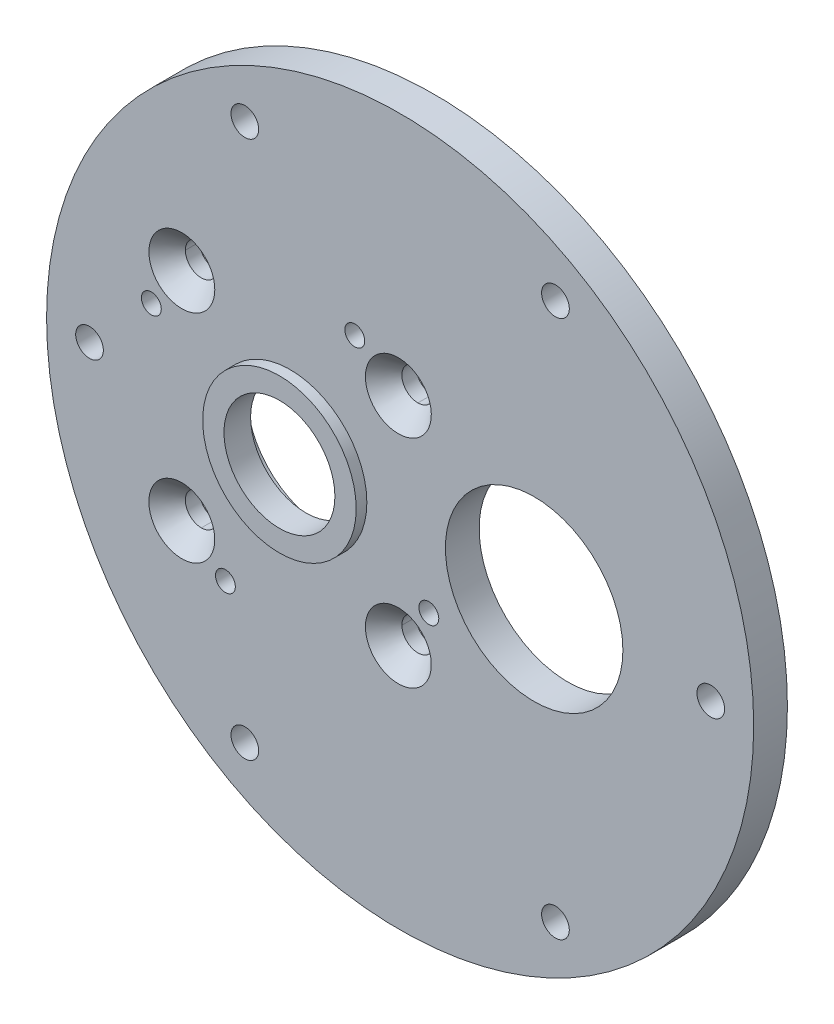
ISO-10303-21;
HEADER;
FILE_DESCRIPTION(('STEP AP214'),'2;1');
FILE_NAME('part.step','',(''),(''),'','','');
FILE_SCHEMA(('AUTOMOTIVE_DESIGN { 1 0 10303 214 1 1 1 1 }'));
ENDSEC;
DATA;
#1=APPLICATION_CONTEXT('core data for automotive mechanical design processes');
#2=APPLICATION_PROTOCOL_DEFINITION('international standard','automotive_design',2000,#1);
#3=PRODUCT_CONTEXT('',#1,'mechanical');
#4=PRODUCT('Part','Part','',(#3));
#5=PRODUCT_RELATED_PRODUCT_CATEGORY('part','',(#4));
#6=PRODUCT_DEFINITION_FORMATION('','',#4);
#7=PRODUCT_DEFINITION_CONTEXT('part definition',#1,'design');
#8=PRODUCT_DEFINITION('design','',#6,#7);
#9=PRODUCT_DEFINITION_SHAPE('','',#8);
#10=(LENGTH_UNIT() NAMED_UNIT(*) SI_UNIT(.MILLI.,.METRE.));
#11=(NAMED_UNIT(*) PLANE_ANGLE_UNIT() SI_UNIT($,.RADIAN.));
#12=(NAMED_UNIT(*) SI_UNIT($,.STERADIAN.) SOLID_ANGLE_UNIT());
#13=UNCERTAINTY_MEASURE_WITH_UNIT(LENGTH_MEASURE(1.E-05),#10,'distance_accuracy_value','');
#14=(GEOMETRIC_REPRESENTATION_CONTEXT(3) GLOBAL_UNCERTAINTY_ASSIGNED_CONTEXT((#13)) GLOBAL_UNIT_ASSIGNED_CONTEXT((#10,
#11,#12)) REPRESENTATION_CONTEXT('',''));
#15=CARTESIAN_POINT('',(0.,0.,0.));
#16=DIRECTION('',(0.,0.,1.));
#17=DIRECTION('',(1.,0.,0.));
#18=AXIS2_PLACEMENT_3D('',#15,#16,#17);
#19=CARTESIAN_POINT('',(15.748,3.88578058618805E-13,4.826));
#20=DIRECTION('',(0.,0.,1.));
#21=DIRECTION('',(1.,0.,0.));
#22=AXIS2_PLACEMENT_3D('',#19,#20,#21);
#23=PLANE('',#22);
#24=CARTESIAN_POINT('',(15.4909418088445,-15.4939999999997,4.82600000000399));
#25=DIRECTION('',(0.,0.,1.));
#26=DIRECTION('',(-1.,0.,0.));
#27=AXIS2_PLACEMENT_3D('',#24,#25,#26);
#28=CIRCLE('',#27,4.71478714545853);
#29=CARTESIAN_POINT('',(10.776154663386,-15.4939999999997,4.82600000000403));
#30=VERTEX_POINT('',#29);
#31=EDGE_CURVE('E253',#30,#30,#28,.T.);
#32=ORIENTED_EDGE('',*,*,#31,.F.);
#33=EDGE_LOOP('',(#32));
#34=FACE_BOUND('',#33,.T.);
#35=CARTESIAN_POINT('',(-15.4909418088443,15.494,4.82600000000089));
#36=DIRECTION('',(0.,0.,1.));
#37=DIRECTION('',(1.,0.,0.));
#38=AXIS2_PLACEMENT_3D('',#35,#36,#37);
#39=CIRCLE('',#38,4.71478714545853);
#40=CARTESIAN_POINT('',(-10.7761546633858,15.494,4.82600000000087));
#41=VERTEX_POINT('',#40);
#42=EDGE_CURVE('E651',#41,#41,#39,.T.);
#43=ORIENTED_EDGE('',*,*,#42,.F.);
#44=EDGE_LOOP('',(#43));
#45=FACE_BOUND('',#44,.T.);
#46=CARTESIAN_POINT('',(34.9250000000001,0.,4.82600000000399));
#47=DIRECTION('',(0.,0.,1.));
#48=DIRECTION('',(1.,0.,0.));
#49=AXIS2_PLACEMENT_3D('',#46,#47,#48);
#50=CIRCLE('',#49,12.7);
#51=CARTESIAN_POINT('',(47.6250000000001,0.,4.82600000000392));
#52=VERTEX_POINT('',#51);
#53=EDGE_CURVE('E154',#52,#52,#50,.T.);
#54=ORIENTED_EDGE('',*,*,#53,.F.);
#55=EDGE_LOOP('',(#54));
#56=FACE_BOUND('',#55,.T.);
#57=CARTESIAN_POINT('',(37.9730000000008,38.4948291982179,4.826));
#58=DIRECTION('',(0.,0.,1.));
#59=DIRECTION('',(0.500000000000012,0.866025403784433,0.));
#60=AXIS2_PLACEMENT_3D('',#57,#58,#59);
#61=CIRCLE('',#60,1.9812);
#62=CARTESIAN_POINT('',(38.9636000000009,40.2105987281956,4.826));
#63=VERTEX_POINT('',#62);
#64=EDGE_CURVE('E658',#63,#63,#61,.T.);
#65=ORIENTED_EDGE('',*,*,#64,.F.);
#66=EDGE_LOOP('',(#65));
#67=FACE_BOUND('',#66,.T.);
#68=CARTESIAN_POINT('',(-6.47699999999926,38.4948291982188,4.826));
#69=DIRECTION('',(0.,0.,1.));
#70=DIRECTION('',(-0.499999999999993,0.866025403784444,0.));
#71=AXIS2_PLACEMENT_3D('',#68,#69,#70);
#72=CIRCLE('',#71,1.9812);
#73=CARTESIAN_POINT('',(-7.46759999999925,40.2105987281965,4.82600000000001));
#74=VERTEX_POINT('',#73);
#75=EDGE_CURVE('E662',#74,#74,#72,.T.);
#76=ORIENTED_EDGE('',*,*,#75,.F.);
#77=EDGE_LOOP('',(#76));
#78=FACE_BOUND('',#77,.T.);
#79=CARTESIAN_POINT('',(-28.7020000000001,1.1518563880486E-12,4.825999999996));
#80=DIRECTION('',(0.,0.,1.));
#81=DIRECTION('',(-1.,0.,0.));
#82=AXIS2_PLACEMENT_3D('',#79,#80,#81);
#83=CIRCLE('',#82,1.9812);
#84=CARTESIAN_POINT('',(-30.6832000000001,1.16533926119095E-12,4.82599999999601));
#85=VERTEX_POINT('',#84);
#86=EDGE_CURVE('E666',#85,#85,#83,.T.);
#87=ORIENTED_EDGE('',*,*,#86,.F.);
#88=EDGE_LOOP('',(#87));
#89=FACE_BOUND('',#88,.T.);
#90=CARTESIAN_POINT('',(-6.47699999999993,-38.4948291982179,4.82600000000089));
#91=DIRECTION('',(0.,0.,1.));
#92=DIRECTION('',(-0.500000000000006,-0.866025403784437,0.));
#93=AXIS2_PLACEMENT_3D('',#90,#91,#92);
#94=CIRCLE('',#93,1.9812);
#95=CARTESIAN_POINT('',(-7.46759999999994,-40.2105987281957,4.82600000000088));
#96=VERTEX_POINT('',#95);
#97=EDGE_CURVE('E670',#96,#96,#94,.T.);
#98=ORIENTED_EDGE('',*,*,#97,.F.);
#99=EDGE_LOOP('',(#98));
#100=FACE_BOUND('',#99,.T.);
#101=CARTESIAN_POINT('',(37.9729999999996,-38.4948291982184,4.82600000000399));
#102=DIRECTION('',(0.,0.,1.));
#103=DIRECTION('',(0.499999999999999,-0.866025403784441,0.));
#104=AXIS2_PLACEMENT_3D('',#101,#102,#103);
#105=CIRCLE('',#104,1.9812);
#106=CARTESIAN_POINT('',(38.9635999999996,-40.2105987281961,4.82600000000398));
#107=VERTEX_POINT('',#106);
#108=EDGE_CURVE('E674',#107,#107,#105,.T.);
#109=ORIENTED_EDGE('',*,*,#108,.F.);
#110=EDGE_LOOP('',(#109));
#111=FACE_BOUND('',#110,.T.);
#112=CARTESIAN_POINT('',(60.1979999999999,-4.44089209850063E-13,4.82600000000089));
#113=DIRECTION('',(0.,0.,1.));
#114=DIRECTION('',(1.,0.,0.));
#115=AXIS2_PLACEMENT_3D('',#112,#113,#114);
#116=CIRCLE('',#115,1.9812);
#117=CARTESIAN_POINT('',(62.1792,-4.43738181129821E-13,4.82600000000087));
#118=VERTEX_POINT('',#117);
#119=EDGE_CURVE('E126',#118,#118,#116,.T.);
#120=ORIENTED_EDGE('',*,*,#119,.F.);
#121=EDGE_LOOP('',(#120));
#122=FACE_BOUND('',#121,.T.);
#123=CARTESIAN_POINT('',(15.748,3.88578058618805E-13,4.826));
#124=DIRECTION('',(0.,0.,1.));
#125=DIRECTION('',(1.,0.,0.));
#126=AXIS2_PLACEMENT_3D('',#123,#124,#125);
#127=CIRCLE('',#126,50.5968);
#128=CARTESIAN_POINT('',(66.3448,3.97542792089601E-13,4.82599999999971));
#129=VERTEX_POINT('',#128);
#130=EDGE_CURVE('E147',#129,#129,#127,.T.);
#131=ORIENTED_EDGE('',*,*,#130,.T.);
#132=EDGE_LOOP('',(#131));
#133=FACE_BOUND('',#132,.T.);
#134=CARTESIAN_POINT('',(0.,0.,4.82600000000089));
#135=DIRECTION('',(0.,0.,1.));
#136=DIRECTION('',(1.,0.,0.));
#137=AXIS2_PLACEMENT_3D('',#134,#135,#136);
#138=CIRCLE('',#137,10.9855);
#139=CARTESIAN_POINT('',(10.9855000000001,0.,4.82600000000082));
#140=VERTEX_POINT('',#139);
#141=EDGE_CURVE('E138',#140,#140,#138,.T.);
#142=ORIENTED_EDGE('',*,*,#141,.F.);
#143=EDGE_LOOP('',(#142));
#144=FACE_BOUND('',#143,.T.);
#145=CARTESIAN_POINT('',(19.8549378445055,-9.25850956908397,4.826));
#146=DIRECTION('',(0.,0.,1.));
#147=DIRECTION('',(1.,0.,0.));
#148=AXIS2_PLACEMENT_3D('',#145,#146,#147);
#149=CIRCLE('',#148,1.4224);
#150=CARTESIAN_POINT('',(21.2773378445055,-9.25850956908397,4.82599999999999));
#151=VERTEX_POINT('',#150);
#152=EDGE_CURVE('E171',#151,#151,#149,.T.);
#153=ORIENTED_EDGE('',*,*,#152,.F.);
#154=EDGE_LOOP('',(#153));
#155=FACE_BOUND('',#154,.T.);
#156=CARTESIAN_POINT('',(9.25850956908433,19.8549378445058,4.82600000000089));
#157=DIRECTION('',(0.,0.,1.));
#158=DIRECTION('',(0.,1.,0.));
#159=AXIS2_PLACEMENT_3D('',#156,#157,#158);
#160=CIRCLE('',#159,1.4224);
#161=CARTESIAN_POINT('',(9.25850956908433,21.2773378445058,4.82600000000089));
#162=VERTEX_POINT('',#161);
#163=EDGE_CURVE('E175',#162,#162,#160,.T.);
#164=ORIENTED_EDGE('',*,*,#163,.F.);
#165=EDGE_LOOP('',(#164));
#166=FACE_BOUND('',#165,.T.);
#167=CARTESIAN_POINT('',(-19.8549378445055,9.25850956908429,4.82600000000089));
#168=DIRECTION('',(0.,0.,1.));
#169=DIRECTION('',(-1.,0.,0.));
#170=AXIS2_PLACEMENT_3D('',#167,#168,#169);
#171=CIRCLE('',#170,1.4224);
#172=CARTESIAN_POINT('',(-21.2773378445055,9.25850956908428,4.82600000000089));
#173=VERTEX_POINT('',#172);
#174=EDGE_CURVE('E179',#173,#173,#171,.T.);
#175=ORIENTED_EDGE('',*,*,#174,.F.);
#176=EDGE_LOOP('',(#175));
#177=FACE_BOUND('',#176,.T.);
#178=CARTESIAN_POINT('',(-9.25850956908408,-19.8549378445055,4.82600000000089));
#179=DIRECTION('',(0.,0.,1.));
#180=DIRECTION('',(0.,-1.,0.));
#181=AXIS2_PLACEMENT_3D('',#178,#179,#180);
#182=CIRCLE('',#181,1.4224);
#183=CARTESIAN_POINT('',(-9.25850956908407,-21.2773378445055,4.82600000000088));
#184=VERTEX_POINT('',#183);
#185=EDGE_CURVE('E183',#184,#184,#182,.T.);
#186=ORIENTED_EDGE('',*,*,#185,.F.);
#187=EDGE_LOOP('',(#186));
#188=FACE_BOUND('',#187,.T.);
#189=CARTESIAN_POINT('',(-15.4939999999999,-15.4909418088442,4.82600000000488));
#190=DIRECTION('',(0.,0.,1.));
#191=DIRECTION('',(0.,1.,0.));
#192=AXIS2_PLACEMENT_3D('',#189,#190,#191);
#193=CIRCLE('',#192,4.71478714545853);
#194=CARTESIAN_POINT('',(-15.4939999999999,-10.7761546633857,4.82600000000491));
#195=VERTEX_POINT('',#194);
#196=EDGE_CURVE('E298',#195,#195,#193,.T.);
#197=ORIENTED_EDGE('',*,*,#196,.F.);
#198=EDGE_LOOP('',(#197));
#199=FACE_BOUND('',#198,.T.);
#200=CARTESIAN_POINT('',(15.494,15.4909418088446,4.82600000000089));
#201=DIRECTION('',(0.,0.,1.));
#202=DIRECTION('',(0.,-1.,0.));
#203=AXIS2_PLACEMENT_3D('',#200,#201,#202);
#204=CIRCLE('',#203,4.71478714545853);
#205=CARTESIAN_POINT('',(15.494,10.776154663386,4.82600000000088));
#206=VERTEX_POINT('',#205);
#207=EDGE_CURVE('E106',#206,#206,#204,.T.);
#208=ORIENTED_EDGE('',*,*,#207,.F.);
#209=EDGE_LOOP('',(#208));
#210=FACE_BOUND('',#209,.T.);
#211=ADVANCED_FACE('F36',(#34,#45,#56,#67,#78,#89,#100,#111,#122,#133,#144,#155,#166,#177,#188,
#199,#210),#23,.T.);
#212=CARTESIAN_POINT('',(15.7480000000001,3.33066907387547E-13,4.88498130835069E-12));
#213=DIRECTION('',(0.,0.,1.));
#214=DIRECTION('',(1.,0.,0.));
#215=AXIS2_PLACEMENT_3D('',#212,#213,#214);
#216=PLANE('',#215);
#217=CARTESIAN_POINT('',(15.4909418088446,-15.4939999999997,3.99680288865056E-12));
#218=DIRECTION('',(0.,0.,1.));
#219=DIRECTION('',(-1.,0.,0.));
#220=AXIS2_PLACEMENT_3D('',#217,#218,#219);
#221=CIRCLE('',#220,2.286);
#222=CARTESIAN_POINT('',(13.2049423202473,-15.4924709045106,8.88178419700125E-13));
#223=VERTEX_POINT('',#222);
#224=CARTESIAN_POINT('',(17.7769412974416,-15.4924709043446,0.));
#225=VERTEX_POINT('',#224);
#226=EDGE_CURVE('E59',#223,#225,#221,.T.);
#227=ORIENTED_EDGE('',*,*,#226,.T.);
#228=CARTESIAN_POINT('',(15.4909418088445,-15.4909418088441,8.88178419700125E-13));
#229=DIRECTION('',(0.,0.,-1.));
#230=DIRECTION('',(-1.,0.,0.));
#231=AXIS2_PLACEMENT_3D('',#228,#229,#230);
#232=CIRCLE('',#231,2.286);
#233=EDGE_CURVE('E119',#223,#225,#232,.T.);
#234=ORIENTED_EDGE('',*,*,#233,.F.);
#235=EDGE_LOOP('',(#227,#234));
#236=FACE_BOUND('',#235,.T.);
#237=CARTESIAN_POINT('',(-15.4909418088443,15.4940000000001,8.88178419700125E-13));
#238=DIRECTION('',(0.,0.,1.));
#239=DIRECTION('',(1.,0.,0.));
#240=AXIS2_PLACEMENT_3D('',#237,#238,#239);
#241=CIRCLE('',#240,2.286);
#242=CARTESIAN_POINT('',(-13.2049423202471,15.4924709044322,0.));
#243=VERTEX_POINT('',#242);
#244=CARTESIAN_POINT('',(-17.7769412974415,15.4924709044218,8.88178419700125E-13));
#245=VERTEX_POINT('',#244);
#246=EDGE_CURVE('E170',#243,#245,#241,.T.);
#247=ORIENTED_EDGE('',*,*,#246,.T.);
#248=CARTESIAN_POINT('',(-15.4909418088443,15.4909418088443,0.));
#249=DIRECTION('',(0.,0.,-1.));
#250=DIRECTION('',(-1.,0.,0.));
#251=AXIS2_PLACEMENT_3D('',#248,#249,#250);
#252=CIRCLE('',#251,2.286);
#253=EDGE_CURVE('E123',#243,#245,#252,.T.);
#254=ORIENTED_EDGE('',*,*,#253,.F.);
#255=EDGE_LOOP('',(#247,#254));
#256=FACE_BOUND('',#255,.T.);
#257=CARTESIAN_POINT('',(0.,0.,0.));
#258=DIRECTION('',(0.,0.,-1.));
#259=DIRECTION('',(-1.,0.,0.));
#260=AXIS2_PLACEMENT_3D('',#257,#258,#259);
#261=CIRCLE('',#260,10.9982);
#262=CARTESIAN_POINT('',(-10.9982,0.,0.));
#263=VERTEX_POINT('',#262);
#264=EDGE_CURVE('E601',#263,#263,#261,.T.);
#265=ORIENTED_EDGE('',*,*,#264,.F.);
#266=EDGE_LOOP('',(#265));
#267=FACE_BOUND('',#266,.T.);
#268=CARTESIAN_POINT('',(34.9250000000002,0.,0.));
#269=DIRECTION('',(0.,0.,1.));
#270=DIRECTION('',(1.,0.,0.));
#271=AXIS2_PLACEMENT_3D('',#268,#269,#270);
#272=CIRCLE('',#271,12.7);
#273=CARTESIAN_POINT('',(47.6250000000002,0.,0.));
#274=VERTEX_POINT('',#273);
#275=EDGE_CURVE('E605',#274,#274,#272,.T.);
#276=ORIENTED_EDGE('',*,*,#275,.T.);
#277=EDGE_LOOP('',(#276));
#278=FACE_BOUND('',#277,.T.);
#279=CARTESIAN_POINT('',(37.9730000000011,38.4948291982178,0.));
#280=DIRECTION('',(0.,0.,1.));
#281=DIRECTION('',(0.500000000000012,0.866025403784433,0.));
#282=AXIS2_PLACEMENT_3D('',#279,#280,#281);
#283=CIRCLE('',#282,1.9812);
#284=CARTESIAN_POINT('',(38.9636000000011,40.2105987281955,0.));
#285=VERTEX_POINT('',#284);
#286=EDGE_CURVE('E609',#285,#285,#283,.T.);
#287=ORIENTED_EDGE('',*,*,#286,.T.);
#288=EDGE_LOOP('',(#287));
#289=FACE_BOUND('',#288,.T.);
#290=CARTESIAN_POINT('',(-6.47699999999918,38.4948291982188,8.88178419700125E-13));
#291=DIRECTION('',(0.,0.,1.));
#292=DIRECTION('',(-0.499999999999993,0.866025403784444,0.));
#293=AXIS2_PLACEMENT_3D('',#290,#291,#292);
#294=CIRCLE('',#293,1.9812);
#295=CARTESIAN_POINT('',(-7.46759999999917,40.2105987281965,9.0109747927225E-13));
#296=VERTEX_POINT('',#295);
#297=EDGE_CURVE('E613',#296,#296,#294,.T.);
#298=ORIENTED_EDGE('',*,*,#297,.T.);
#299=EDGE_LOOP('',(#298));
#300=FACE_BOUND('',#299,.T.);
#301=CARTESIAN_POINT('',(-28.702,1.12410081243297E-12,0.));
#302=DIRECTION('',(0.,0.,1.));
#303=DIRECTION('',(-1.,0.,0.));
#304=AXIS2_PLACEMENT_3D('',#301,#302,#303);
#305=CIRCLE('',#304,1.9812);
#306=CARTESIAN_POINT('',(-30.6832,1.13758368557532E-12,0.));
#307=VERTEX_POINT('',#306);
#308=EDGE_CURVE('E617',#307,#307,#305,.T.);
#309=ORIENTED_EDGE('',*,*,#308,.T.);
#310=EDGE_LOOP('',(#309));
#311=FACE_BOUND('',#310,.T.);
#312=CARTESIAN_POINT('',(-6.47699999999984,-38.494829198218,0.));
#313=DIRECTION('',(0.,0.,1.));
#314=DIRECTION('',(-0.500000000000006,-0.866025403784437,0.));
#315=AXIS2_PLACEMENT_3D('',#312,#313,#314);
#316=CIRCLE('',#315,1.9812);
#317=CARTESIAN_POINT('',(-7.46759999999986,-40.2105987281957,0.));
#318=VERTEX_POINT('',#317);
#319=EDGE_CURVE('E621',#318,#318,#316,.T.);
#320=ORIENTED_EDGE('',*,*,#319,.T.);
#321=EDGE_LOOP('',(#320));
#322=FACE_BOUND('',#321,.T.);
#323=CARTESIAN_POINT('',(37.9729999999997,-38.4948291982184,0.));
#324=DIRECTION('',(0.,0.,1.));
#325=DIRECTION('',(0.499999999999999,-0.866025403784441,0.));
#326=AXIS2_PLACEMENT_3D('',#323,#324,#325);
#327=CIRCLE('',#326,1.9812);
#328=CARTESIAN_POINT('',(38.9635999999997,-40.2105987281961,0.));
#329=VERTEX_POINT('',#328);
#330=EDGE_CURVE('E625',#329,#329,#327,.T.);
#331=ORIENTED_EDGE('',*,*,#330,.T.);
#332=EDGE_LOOP('',(#331));
#333=FACE_BOUND('',#332,.T.);
#334=CARTESIAN_POINT('',(60.1980000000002,-4.44089209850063E-13,3.99680288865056E-12));
#335=DIRECTION('',(0.,0.,1.));
#336=DIRECTION('',(1.,0.,0.));
#337=AXIS2_PLACEMENT_3D('',#334,#335,#336);
#338=CIRCLE('',#337,1.9812);
#339=CARTESIAN_POINT('',(62.1792000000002,-4.43738181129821E-13,3.9856744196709E-12));
#340=VERTEX_POINT('',#339);
#341=EDGE_CURVE('E120',#340,#340,#338,.T.);
#342=ORIENTED_EDGE('',*,*,#341,.T.);
#343=EDGE_LOOP('',(#342));
#344=FACE_BOUND('',#343,.T.);
#345=CARTESIAN_POINT('',(15.7480000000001,3.33066907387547E-13,4.88498130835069E-12));
#346=DIRECTION('',(0.,0.,1.));
#347=DIRECTION('',(1.,0.,0.));
#348=AXIS2_PLACEMENT_3D('',#345,#346,#347);
#349=CIRCLE('',#348,50.5968);
#350=CARTESIAN_POINT('',(66.3448000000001,3.42031640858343E-13,4.60077733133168E-12));
#351=VERTEX_POINT('',#350);
#352=EDGE_CURVE('E144',#351,#351,#349,.T.);
#353=ORIENTED_EDGE('',*,*,#352,.F.);
#354=EDGE_LOOP('',(#353));
#355=FACE_BOUND('',#354,.T.);
#356=CARTESIAN_POINT('',(19.8549378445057,-9.25850956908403,-8.88178419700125E-13));
#357=DIRECTION('',(0.,0.,1.));
#358=DIRECTION('',(1.,0.,0.));
#359=AXIS2_PLACEMENT_3D('',#356,#357,#358);
#360=CIRCLE('',#359,1.4224);
#361=CARTESIAN_POINT('',(21.2773378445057,-9.25850956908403,-8.96168089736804E-13));
#362=VERTEX_POINT('',#361);
#363=EDGE_CURVE('E167',#362,#362,#360,.T.);
#364=ORIENTED_EDGE('',*,*,#363,.T.);
#365=EDGE_LOOP('',(#364));
#366=FACE_BOUND('',#365,.T.);
#367=CARTESIAN_POINT('',(9.25850956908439,19.8549378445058,8.88178419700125E-13));
#368=DIRECTION('',(0.,0.,1.));
#369=DIRECTION('',(1.,0.,0.));
#370=AXIS2_PLACEMENT_3D('',#367,#368,#369);
#371=CIRCLE('',#370,1.4224);
#372=CARTESIAN_POINT('',(10.6809095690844,19.8549378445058,8.80188749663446E-13));
#373=VERTEX_POINT('',#372);
#374=EDGE_CURVE('E172',#373,#373,#371,.T.);
#375=ORIENTED_EDGE('',*,*,#374,.T.);
#376=EDGE_LOOP('',(#375));
#377=FACE_BOUND('',#376,.T.);
#378=CARTESIAN_POINT('',(-19.8549378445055,9.25850956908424,0.));
#379=DIRECTION('',(0.,0.,1.));
#380=DIRECTION('',(1.,0.,0.));
#381=AXIS2_PLACEMENT_3D('',#378,#379,#380);
#382=CIRCLE('',#381,1.4224);
#383=CARTESIAN_POINT('',(-18.4325378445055,9.25850956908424,0.));
#384=VERTEX_POINT('',#383);
#385=EDGE_CURVE('E176',#384,#384,#382,.T.);
#386=ORIENTED_EDGE('',*,*,#385,.T.);
#387=EDGE_LOOP('',(#386));
#388=FACE_BOUND('',#387,.T.);
#389=CARTESIAN_POINT('',(-9.25850956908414,-19.8549378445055,0.));
#390=DIRECTION('',(0.,0.,1.));
#391=DIRECTION('',(1.,0.,0.));
#392=AXIS2_PLACEMENT_3D('',#389,#390,#391);
#393=CIRCLE('',#392,1.4224);
#394=CARTESIAN_POINT('',(-7.83610956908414,-19.8549378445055,0.));
#395=VERTEX_POINT('',#394);
#396=EDGE_CURVE('E180',#395,#395,#393,.T.);
#397=ORIENTED_EDGE('',*,*,#396,.T.);
#398=EDGE_LOOP('',(#397));
#399=FACE_BOUND('',#398,.T.);
#400=CARTESIAN_POINT('',(-15.4939999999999,-15.4909418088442,0.));
#401=DIRECTION('',(0.,0.,1.));
#402=DIRECTION('',(0.,1.,0.));
#403=AXIS2_PLACEMENT_3D('',#400,#401,#402);
#404=CIRCLE('',#403,2.286);
#405=CARTESIAN_POINT('',(-15.4924709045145,-13.2049423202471,8.88178419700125E-13));
#406=VERTEX_POINT('',#405);
#407=CARTESIAN_POINT('',(-15.4924709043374,-17.7769412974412,8.88178419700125E-13));
#408=VERTEX_POINT('',#407);
#409=EDGE_CURVE('E299',#406,#408,#404,.T.);
#410=ORIENTED_EDGE('',*,*,#409,.T.);
#411=CARTESIAN_POINT('',(-15.4909418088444,-15.4909418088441,0.));
#412=DIRECTION('',(0.,0.,1.));
#413=DIRECTION('',(1.,0.,0.));
#414=AXIS2_PLACEMENT_3D('',#411,#412,#413);
#415=CIRCLE('',#414,2.286);
#416=EDGE_CURVE('E132',#408,#406,#415,.T.);
#417=ORIENTED_EDGE('',*,*,#416,.T.);
#418=EDGE_LOOP('',(#410,#417));
#419=FACE_BOUND('',#418,.T.);
#420=CARTESIAN_POINT('',(15.494,15.4909418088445,4.88498130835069E-12));
#421=DIRECTION('',(0.,0.,1.));
#422=DIRECTION('',(0.,-1.,0.));
#423=AXIS2_PLACEMENT_3D('',#420,#421,#422);
#424=CIRCLE('',#423,2.286);
#425=CARTESIAN_POINT('',(15.4924709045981,13.2049423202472,0.));
#426=VERTEX_POINT('',#425);
#427=CARTESIAN_POINT('',(15.4924709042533,17.7769412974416,8.88178419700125E-13));
#428=VERTEX_POINT('',#427);
#429=EDGE_CURVE('E51',#426,#428,#424,.T.);
#430=ORIENTED_EDGE('',*,*,#429,.T.);
#431=CARTESIAN_POINT('',(15.4909418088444,15.4909418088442,3.99680288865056E-12));
#432=DIRECTION('',(0.,0.,1.));
#433=DIRECTION('',(1.,0.,0.));
#434=AXIS2_PLACEMENT_3D('',#431,#432,#433);
#435=CIRCLE('',#434,2.286);
#436=EDGE_CURVE('E117',#428,#426,#435,.T.);
#437=ORIENTED_EDGE('',*,*,#436,.T.);
#438=EDGE_LOOP('',(#430,#437));
#439=FACE_BOUND('',#438,.T.);
#440=ADVANCED_FACE('F225',(#236,#256,#267,#278,#289,#300,#311,#322,#333,#344,#355,#366,#377,
#388,#399,#419,#439),#216,.F.);
#441=CARTESIAN_POINT('',(15.4909418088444,15.4909418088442,3.99680288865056E-12));
#442=DIRECTION('',(0.,0.,1.));
#443=DIRECTION('',(1.,0.,0.));
#444=AXIS2_PLACEMENT_3D('',#441,#442,#443);
#445=CYLINDRICAL_SURFACE('',#444,2.286);
#446=DIRECTION('',(0.,0.,1.));
#447=VECTOR('',#446,1.);
#448=CARTESIAN_POINT('',(15.4924709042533,17.7769412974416,1.01599999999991));
#449=LINE('',#448,#447);
#450=CARTESIAN_POINT('',(15.4924709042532,17.7769412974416,2.03200000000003));
#451=VERTEX_POINT('',#450);
#452=EDGE_CURVE('E11',#451,#428,#449,.F.);
#453=ORIENTED_EDGE('',*,*,#452,.F.);
#454=CARTESIAN_POINT('',(15.4924709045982,13.2049423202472,2.03200000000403));
#455=CARTESIAN_POINT('',(15.4550809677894,13.2049165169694,2.03205754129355));
#456=CARTESIAN_POINT('',(15.4176904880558,13.2058103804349,2.03211418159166));
#457=CARTESIAN_POINT('',(15.3429960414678,13.2094317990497,2.03222566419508));
#458=CARTESIAN_POINT('',(15.3056920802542,13.212159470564,2.03228050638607));
#459=CARTESIAN_POINT('',(15.2312607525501,13.2194430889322,2.03238839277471));
#460=CARTESIAN_POINT('',(15.1941333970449,13.2239991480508,2.03244143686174));
#461=CARTESIAN_POINT('',(15.1201448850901,13.2349285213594,2.0325457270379));
#462=CARTESIAN_POINT('',(15.0832837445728,13.241301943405,2.03259697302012));
#463=CARTESIAN_POINT('',(15.0099166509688,13.2558509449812,2.03269766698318));
#464=CARTESIAN_POINT('',(14.9734107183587,13.2640266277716,2.03274711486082));
#465=CARTESIAN_POINT('',(14.9008421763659,13.2821606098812,2.03284421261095));
#466=CARTESIAN_POINT('',(14.8647795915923,13.2921190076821,2.03289186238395));
#467=CARTESIAN_POINT('',(14.7931848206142,13.3137945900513,2.0329853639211));
#468=CARTESIAN_POINT('',(14.7576526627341,13.3255118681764,2.03303121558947));
#469=CARTESIAN_POINT('',(14.6872045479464,13.350677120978,2.03312112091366));
#470=CARTESIAN_POINT('',(14.6522886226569,13.3641251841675,2.03316517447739));
#471=CARTESIAN_POINT('',(14.5831572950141,13.3927197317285,2.03325148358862));
#472=CARTESIAN_POINT('',(14.5489419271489,13.40786629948,2.03329373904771));
#473=CARTESIAN_POINT('',(14.4812943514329,13.4398214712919,2.03337645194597));
#474=CARTESIAN_POINT('',(14.4478621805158,13.4566301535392,2.03341690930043));
#475=CARTESIAN_POINT('',(14.3818617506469,13.491869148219,2.03349602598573));
#476=CARTESIAN_POINT('',(14.3492935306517,13.5102995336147,2.03353468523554));
#477=CARTESIAN_POINT('',(14.2850996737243,13.5487376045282,2.03361020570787));
#478=CARTESIAN_POINT('',(14.2534740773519,13.5687453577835,2.03364706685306));
#479=CARTESIAN_POINT('',(14.1912418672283,13.6102900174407,2.03371899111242));
#480=CARTESIAN_POINT('',(14.1606352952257,13.6318269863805,2.03375405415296));
#481=CARTESIAN_POINT('',(14.1005150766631,13.676378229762,2.03382238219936));
#482=CARTESIAN_POINT('',(14.0710014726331,13.6993925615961,2.03385564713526));
#483=CARTESIAN_POINT('',(14.0131384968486,13.7468431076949,2.03392037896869));
#484=CARTESIAN_POINT('',(13.9847891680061,13.7712793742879,2.03395184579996));
#485=CARTESIAN_POINT('',(13.9293232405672,13.8215149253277,2.03401298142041));
#486=CARTESIAN_POINT('',(13.9022066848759,13.8473142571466,2.03404265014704));
#487=CARTESIAN_POINT('',(13.8492718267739,13.9002137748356,2.03410018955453));
#488=CARTESIAN_POINT('',(13.8234535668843,13.9273140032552,2.03412806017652));
#489=CARTESIAN_POINT('',(13.773177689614,13.9827500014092,2.03418200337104));
#490=CARTESIAN_POINT('',(13.7487201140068,14.0110858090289,2.03420807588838));
#491=CARTESIAN_POINT('',(13.701224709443,14.0689246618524,2.03425842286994));
#492=CARTESIAN_POINT('',(13.6781869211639,14.0984277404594,2.03428269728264));
#493=CARTESIAN_POINT('',(13.6335867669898,14.1585300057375,2.03432944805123));
#494=CARTESIAN_POINT('',(13.6120244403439,14.1891292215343,2.03435192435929));
#495=CARTESIAN_POINT('',(13.5704273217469,14.2513499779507,2.03439507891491));
#496=CARTESIAN_POINT('',(13.5503925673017,14.2829715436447,2.03441575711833));
#497=CARTESIAN_POINT('',(13.5118990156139,14.3471607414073,2.03445531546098));
#498=CARTESIAN_POINT('',(13.4934402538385,14.3797283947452,2.03447419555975));
#499=CARTESIAN_POINT('',(13.4581433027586,14.4457312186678,2.03451015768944));
#500=CARTESIAN_POINT('',(13.4413051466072,14.4791664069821,2.03452723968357));
#501=CARTESIAN_POINT('',(13.4092901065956,14.5468236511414,2.03455960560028));
#502=CARTESIAN_POINT('',(13.3941132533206,14.5810457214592,2.03457488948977));
#503=CARTESIAN_POINT('',(13.3654575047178,14.6501941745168,2.03460365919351));
#504=CARTESIAN_POINT('',(13.3519786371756,14.6851205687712,2.03461714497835));
#505=CARTESIAN_POINT('',(13.3267514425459,14.755593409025,2.03464231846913));
#506=CARTESIAN_POINT('',(13.3150031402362,14.791139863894,2.03465400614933));
#507=CARTESIAN_POINT('',(13.2932654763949,14.8627670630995,2.03467558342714));
#508=CARTESIAN_POINT('',(13.283276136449,14.898847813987,2.03468547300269));
#509=CARTESIAN_POINT('',(13.2650805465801,14.9714565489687,2.03470345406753));
#510=CARTESIAN_POINT('',(13.2568743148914,15.0079845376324,2.03471154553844));
#511=CARTESIAN_POINT('',(13.242264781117,15.0813996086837,2.03472593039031));
#512=CARTESIAN_POINT('',(13.2358614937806,15.1182866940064,2.03473222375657));
#513=CARTESIAN_POINT('',(13.2248733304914,15.1923309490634,2.03474301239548));
#514=CARTESIAN_POINT('',(13.2202884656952,15.2294881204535,2.03474750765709));
#515=CARTESIAN_POINT('',(13.2129482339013,15.3039828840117,2.03475470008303));
#516=CARTESIAN_POINT('',(13.2101928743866,15.3413204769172,2.03475739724));
#517=CARTESIAN_POINT('',(13.2065183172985,15.4160859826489,2.03476099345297));
#518=CARTESIAN_POINT('',(13.2055991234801,15.4535138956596,2.03476189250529));
#519=CARTESIAN_POINT('',(13.2055991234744,15.5283697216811,2.03476189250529));
#520=CARTESIAN_POINT('',(13.2065183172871,15.565797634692,2.03476099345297));
#521=CARTESIAN_POINT('',(13.2101928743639,15.6405631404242,2.03475739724));
#522=CARTESIAN_POINT('',(13.2129482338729,15.6779007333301,2.03475470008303));
#523=CARTESIAN_POINT('',(13.2202884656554,15.7523954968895,2.03474750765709));
#524=CARTESIAN_POINT('',(13.2248733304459,15.7895526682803,2.03474301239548));
#525=CARTESIAN_POINT('',(13.2358614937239,15.863596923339,2.03473222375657));
#526=CARTESIAN_POINT('',(13.2422647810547,15.9004840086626,2.03472593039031));
#527=CARTESIAN_POINT('',(13.2568743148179,15.9738990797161,2.03471154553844));
#528=CARTESIAN_POINT('',(13.265080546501,16.0104270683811,2.03470345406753));
#529=CARTESIAN_POINT('',(13.2832761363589,16.0830358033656,2.03468547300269));
#530=CARTESIAN_POINT('',(13.2932654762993,16.1191165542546,2.03467558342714));
#531=CARTESIAN_POINT('',(13.3150031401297,16.1907437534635,2.03465400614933));
#532=CARTESIAN_POINT('',(13.326751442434,16.2262902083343,2.03464231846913));
#533=CARTESIAN_POINT('',(13.351978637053,16.2967630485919,2.03461714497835));
#534=CARTESIAN_POINT('',(13.3654575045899,16.3316894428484,2.03460365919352));
#535=CARTESIAN_POINT('',(13.3941132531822,16.4008378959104,2.03457488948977));
#536=CARTESIAN_POINT('',(13.409290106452,16.4350599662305,2.03455960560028));
#537=CARTESIAN_POINT('',(13.4413051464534,16.5027172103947,2.03452723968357));
#538=CARTESIAN_POINT('',(13.4581433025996,16.5361523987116,2.03451015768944));
#539=CARTESIAN_POINT('',(13.4934402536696,16.6021552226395,2.03447419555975));
#540=CARTESIAN_POINT('',(13.51189901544,16.6347228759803,2.03445531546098));
#541=CARTESIAN_POINT('',(13.550392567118,16.6989120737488,2.03441575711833));
#542=CARTESIAN_POINT('',(13.5704273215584,16.7305336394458,2.03439507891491));
#543=CARTESIAN_POINT('',(13.612024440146,16.7927543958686,2.03435192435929));
#544=CARTESIAN_POINT('',(13.6335867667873,16.8233536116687,2.03432944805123));
#545=CARTESIAN_POINT('',(13.6781869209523,16.8834558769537,2.03428269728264));
#546=CARTESIAN_POINT('',(13.7012247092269,16.9129589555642,2.03425842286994));
#547=CARTESIAN_POINT('',(13.748720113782,16.970797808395,2.03420807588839));
#548=CARTESIAN_POINT('',(13.7731776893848,16.9991336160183,2.03418200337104));
#549=CARTESIAN_POINT('',(13.8234535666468,17.05456961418,2.03412806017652));
#550=CARTESIAN_POINT('',(13.8492718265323,17.0816698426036,2.03410018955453));
#551=CARTESIAN_POINT('',(13.9022066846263,17.1345693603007,2.03404265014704));
#552=CARTESIAN_POINT('',(13.9293232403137,17.1603686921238,2.03401298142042));
#553=CARTESIAN_POINT('',(13.984789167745,17.210604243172,2.03395184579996));
#554=CARTESIAN_POINT('',(14.0131384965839,17.2350405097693,2.03392037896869));
#555=CARTESIAN_POINT('',(14.0710014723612,17.2824910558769,2.03385564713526));
#556=CARTESIAN_POINT('',(14.1005150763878,17.3055053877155,2.03382238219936));
#557=CARTESIAN_POINT('',(14.1606352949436,17.3500566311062,2.03375405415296));
#558=CARTESIAN_POINT('',(14.191241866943,17.3715936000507,2.03371899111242));
#559=CARTESIAN_POINT('',(14.2534740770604,17.4131382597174,2.03364706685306));
#560=CARTESIAN_POINT('',(14.2850996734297,17.4331460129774,2.03361020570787));
#561=CARTESIAN_POINT('',(14.3492935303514,17.4715840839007,2.03353468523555));
#562=CARTESIAN_POINT('',(14.3818617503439,17.4900144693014,2.03349602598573));
#563=CARTESIAN_POINT('',(14.4478621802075,17.5252534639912,2.03341690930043));
#564=CARTESIAN_POINT('',(14.481294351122,17.5420621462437,2.03337645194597));
#565=CARTESIAN_POINT('',(14.5489419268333,17.5740173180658,2.03329373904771));
#566=CARTESIAN_POINT('',(14.5831572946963,17.5891638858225,2.03325148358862));
#567=CARTESIAN_POINT('',(14.6522886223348,17.6177584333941,2.03316517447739));
#568=CARTESIAN_POINT('',(14.6872045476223,17.6312064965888,2.03312112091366));
#569=CARTESIAN_POINT('',(14.7576526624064,17.6563717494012,2.03303121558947));
#570=CARTESIAN_POINT('',(14.7931848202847,17.6680890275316,2.03298536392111));
#571=CARTESIAN_POINT('',(14.8647795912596,17.6897646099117,2.03289186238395));
#572=CARTESIAN_POINT('',(14.9008421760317,17.699723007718,2.03284421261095));
#573=CARTESIAN_POINT('',(14.9734107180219,17.7178569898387,2.03274711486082));
#574=CARTESIAN_POINT('',(15.0099166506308,17.7260326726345,2.03269766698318));
#575=CARTESIAN_POINT('',(15.0832837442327,17.7405816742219,2.03259697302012));
#576=CARTESIAN_POINT('',(15.1201448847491,17.7469550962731,2.0325457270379));
#577=CARTESIAN_POINT('',(15.1941333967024,17.7578844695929,2.03244143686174));
#578=CARTESIAN_POINT('',(15.231260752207,17.7624405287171,2.03238839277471));
#579=CARTESIAN_POINT('',(15.3056920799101,17.7697241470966,2.03228050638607));
#580=CARTESIAN_POINT('',(15.3429960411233,17.7724518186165,2.03222566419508));
#581=CARTESIAN_POINT('',(15.4176904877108,17.7760732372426,2.03211418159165));
#582=CARTESIAN_POINT('',(15.4550809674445,17.7769671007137,2.03205754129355));
#583=CARTESIAN_POINT('',(15.4924709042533,17.7769412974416,2.03200000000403));
#584=B_SPLINE_CURVE_WITH_KNOTS('',3,(#454,#455,#456,#457,#458,#459,#460,#461,#462,#463,#464,
#465,#466,#467,#468,#469,#470,#471,#472,#473,#474,#475,#476,#477,#478,#479,#480,#481,#482,#483,
#484,#485,#486,#487,#488,#489,#490,#491,#492,#493,#494,#495,#496,#497,#498,#499,#500,#501,#502,
#503,#504,#505,#506,#507,#508,#509,#510,#511,#512,#513,#514,#515,#516,#517,#518,#519,#520,#521,
#522,#523,#524,#525,#526,#527,#528,#529,#530,#531,#532,#533,#534,#535,#536,#537,#538,#539,#540,
#541,#542,#543,#544,#545,#546,#547,#548,#549,#550,#551,#552,#553,#554,#555,#556,#557,#558,#559,
#560,#561,#562,#563,#564,#565,#566,#567,#568,#569,#570,#571,#572,#573,#574,#575,#576,#577,#578,
#579,#580,#581,#582,#583),.UNSPECIFIED.,.F.,.F.,(4,2,2,2,2,2,2,2,2,2,2,2,2,2,2,2,2,2,2,2,2,2,2,
2,2,2,2,2,2,2,2,2,2,2,2,2,2,2,2,2,2,2,2,2,2,2,2,2,2,2,2,2,2,2,2,2,2,2,2,2,2,2,2,2,4),(0.,
0.112158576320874,0.224324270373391,0.336496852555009,0.448676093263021,0.560861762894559,
0.673053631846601,0.785251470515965,0.897455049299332,1.00966413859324,1.12187850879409,
1.23409793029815,1.34632217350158,1.45855100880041,1.57078420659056,1.68302153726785,
1.79526277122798,1.90750767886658,2.01975603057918,2.13200759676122,2.24426214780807,
2.35651945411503,2.46877928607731,2.5810414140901,2.69330560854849,2.80557163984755,
2.91783927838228,3.03010829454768,3.14237845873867,3.25464954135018,3.36692131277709,
3.47919354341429,3.59146600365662,3.70373846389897,3.81601069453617,3.9282824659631,
4.04055354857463,4.15282371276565,4.26509272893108,4.37736036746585,4.48962639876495,
4.60189059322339,4.71415272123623,4.82641255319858,4.93866985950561,5.05092441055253,
5.16317597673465,5.27542432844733,5.38766923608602,5.49991047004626,5.61214780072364,
5.7243809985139,5.83660983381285,5.9488340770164,6.06105349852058,6.17326786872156,
6.28547695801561,6.39768053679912,6.50987837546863,6.62207024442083,6.73425591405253,
6.84643515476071,6.9586077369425,7.07077343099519,7.18293200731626),.UNSPECIFIED.);
#585=CARTESIAN_POINT('',(15.4924709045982,13.2049423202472,2.03200000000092));
#586=VERTEX_POINT('',#585);
#587=EDGE_CURVE('E45',#586,#451,#584,.T.);
#588=ORIENTED_EDGE('',*,*,#587,.F.);
#589=DIRECTION('',(0.,0.,1.));
#590=VECTOR('',#589,1.);
#591=CARTESIAN_POINT('',(15.4924709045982,13.2049423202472,1.01600000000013));
#592=LINE('',#591,#590);
#593=EDGE_CURVE('E103',#426,#586,#592,.T.);
#594=ORIENTED_EDGE('',*,*,#593,.F.);
#595=ORIENTED_EDGE('',*,*,#436,.F.);
#596=EDGE_LOOP('',(#453,#588,#594,#595));
#597=FACE_BOUND('',#596,.T.);
#598=ADVANCED_FACE('F115',(#597),#445,.F.);
#599=CARTESIAN_POINT('',(15.4909418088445,-15.4909418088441,8.88178419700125E-13));
#600=DIRECTION('',(0.,0.,1.));
#601=DIRECTION('',(1.,0.,0.));
#602=AXIS2_PLACEMENT_3D('',#599,#600,#601);
#603=CYLINDRICAL_SURFACE('',#602,2.286);
#604=ORIENTED_EDGE('',*,*,#233,.T.);
#605=DIRECTION('',(0.,0.,1.));
#606=VECTOR('',#605,1.);
#607=CARTESIAN_POINT('',(17.7769412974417,-15.4924709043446,1.01599999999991));
#608=LINE('',#607,#606);
#609=CARTESIAN_POINT('',(17.7769412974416,-15.4924709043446,2.03200000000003));
#610=VERTEX_POINT('',#609);
#611=EDGE_CURVE('E207',#225,#610,#608,.T.);
#612=ORIENTED_EDGE('',*,*,#611,.T.);
#613=CARTESIAN_POINT('',(17.7769412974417,-15.4924709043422,2.03200000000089));
#614=CARTESIAN_POINT('',(17.7769414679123,-15.4922160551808,2.03200039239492));
#615=CARTESIAN_POINT('',(17.776941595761,-15.4919612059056,2.03200078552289));
#616=CARTESIAN_POINT('',(17.7769417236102,-15.4915789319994,2.03200137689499));
#617=CARTESIAN_POINT('',(17.7769417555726,-15.4914515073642,2.03200157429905));
#618=CARTESIAN_POINT('',(17.776941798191,-15.4911966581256,2.03200196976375));
#619=CARTESIAN_POINT('',(17.7769418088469,-15.4910692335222,2.0320021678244));
#620=CARTESIAN_POINT('',(17.7769418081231,-15.4537936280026,2.03206010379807));
#621=CARTESIAN_POINT('',(17.7760359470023,-15.4166390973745,2.03211702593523));
#622=CARTESIAN_POINT('',(17.7724143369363,-15.3424152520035,2.03222901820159));
#623=CARTESIAN_POINT('',(17.769698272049,-15.30534595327,2.03228408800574));
#624=CARTESIAN_POINT('',(17.7624617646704,-15.2313764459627,2.0323924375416));
#625=CARTESIAN_POINT('',(17.7579410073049,-15.1944762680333,2.03244571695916));
#626=CARTESIAN_POINT('',(17.7471049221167,-15.1209340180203,2.03255046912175));
#627=CARTESIAN_POINT('',(17.7407892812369,-15.0842919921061,2.03260194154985));
#628=CARTESIAN_POINT('',(17.7263775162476,-15.0113530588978,2.03270308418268));
#629=CARTESIAN_POINT('',(17.7182810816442,-14.975056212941,2.03275275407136));
#630=CARTESIAN_POINT('',(17.7003260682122,-14.9028943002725,2.03285029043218));
#631=CARTESIAN_POINT('',(17.6904671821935,-14.8670293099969,2.03289815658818));
#632=CARTESIAN_POINT('',(17.6690098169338,-14.7958167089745,2.03299208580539));
#633=CARTESIAN_POINT('',(17.6574110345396,-14.7604691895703,2.03303814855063));
#634=CARTESIAN_POINT('',(17.6325005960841,-14.6903760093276,2.03312847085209));
#635=CARTESIAN_POINT('',(17.6191886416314,-14.6556304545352,2.03317273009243));
#636=CARTESIAN_POINT('',(17.5908584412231,-14.5867653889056,2.03325951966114));
#637=CARTESIAN_POINT('',(17.5758370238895,-14.55264718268,2.0333020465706));
#638=CARTESIAN_POINT('',(17.5441414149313,-14.4851800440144,2.03338529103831));
#639=CARTESIAN_POINT('',(17.5274669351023,-14.4518312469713,2.03342600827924));
#640=CARTESIAN_POINT('',(17.4925042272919,-14.3859831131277,2.03350563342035));
#641=CARTESIAN_POINT('',(17.4742157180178,-14.3534839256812,2.03354454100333));
#642=CARTESIAN_POINT('',(17.4360678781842,-14.2894132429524,2.03362054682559));
#643=CARTESIAN_POINT('',(17.4162082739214,-14.2578419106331,2.03365764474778));
#644=CARTESIAN_POINT('',(17.3749649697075,-14.1957030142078,2.03373003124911));
#645=CARTESIAN_POINT('',(17.3535810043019,-14.1651356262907,2.03376531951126));
#646=CARTESIAN_POINT('',(17.3093393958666,-14.105078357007,2.03383408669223));
#647=CARTESIAN_POINT('',(17.2864814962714,-14.0755886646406,2.03386756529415));
#648=CARTESIAN_POINT('',(17.239346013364,-14.0177580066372,2.03393271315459));
#649=CARTESIAN_POINT('',(17.2150681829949,-13.989417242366,2.03396438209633));
#650=CARTESIAN_POINT('',(17.1651502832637,-13.9339529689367,2.03402591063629));
#651=CARTESIAN_POINT('',(17.1395099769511,-13.9068296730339,2.03405576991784));
#652=CARTESIAN_POINT('',(17.0869278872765,-13.853866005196,2.03411367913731));
#653=CARTESIAN_POINT('',(17.0599858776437,-13.8280258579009,2.03414172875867));
#654=CARTESIAN_POINT('',(17.0048643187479,-13.7776911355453,2.03419601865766));
#655=CARTESIAN_POINT('',(16.9766845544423,-13.7531967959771,2.03422225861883));
#656=CARTESIAN_POINT('',(16.9191544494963,-13.7056131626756,2.03427292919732));
#657=CARTESIAN_POINT('',(16.8898039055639,-13.682524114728,2.0342973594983));
#658=CARTESIAN_POINT('',(16.830002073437,-13.6378072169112,2.0343444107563));
#659=CARTESIAN_POINT('',(16.7995505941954,-13.6161796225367,2.03436703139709));
#660=CARTESIAN_POINT('',(16.7376194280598,-13.5744383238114,2.03441046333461));
#661=CARTESIAN_POINT('',(16.7061395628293,-13.554324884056,2.0344312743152));
#662=CARTESIAN_POINT('',(16.6422266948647,-13.5156609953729,2.03447108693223));
#663=CARTESIAN_POINT('',(16.6097935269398,-13.497110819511,2.03449008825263));
#664=CARTESIAN_POINT('',(16.5440514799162,-13.4616188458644,2.03452628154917));
#665=CARTESIAN_POINT('',(16.5107424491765,-13.4446773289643,2.03454347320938));
#666=CARTESIAN_POINT('',(16.443328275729,-13.4124442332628,2.03457604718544));
#667=CARTESIAN_POINT('',(16.4092229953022,-13.3971529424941,2.03459142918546));
#668=CARTESIAN_POINT('',(16.340297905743,-13.3682579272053,2.03462038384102));
#669=CARTESIAN_POINT('',(16.305477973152,-13.3546544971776,2.03463395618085));
#670=CARTESIAN_POINT('',(16.2352069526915,-13.3291688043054,2.03465929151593));
#671=CARTESIAN_POINT('',(16.1997557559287,-13.3172868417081,2.03467105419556));
#672=CARTESIAN_POINT('',(16.1283071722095,-13.2952735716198,2.03469277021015));
#673=CARTESIAN_POINT('',(16.0923096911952,-13.2851425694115,2.0347027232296));
#674=CARTESIAN_POINT('',(16.0198548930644,-13.2666565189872,2.0347208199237));
#675=CARTESIAN_POINT('',(15.98339749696,-13.2583017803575,2.03472896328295));
#676=CARTESIAN_POINT('',(15.9101104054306,-13.2433893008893,2.03474344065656));
#677=CARTESIAN_POINT('',(15.8732806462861,-13.2368318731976,2.03474977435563));
#678=CARTESIAN_POINT('',(15.7993373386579,-13.2255307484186,2.03476063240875));
#679=CARTESIAN_POINT('',(15.762223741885,-13.2207873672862,2.03476515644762));
#680=CARTESIAN_POINT('',(15.6878020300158,-13.2131267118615,2.03477239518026));
#681=CARTESIAN_POINT('',(15.6504938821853,-13.2102097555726,2.03477510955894));
#682=CARTESIAN_POINT('',(15.5757728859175,-13.2062099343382,2.03477872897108));
#683=CARTESIAN_POINT('',(15.5383600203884,-13.2051273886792,2.03477963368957));
#684=CARTESIAN_POINT('',(15.4635197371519,-13.204799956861,2.03477963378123));
#685=CARTESIAN_POINT('',(15.4260923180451,-13.2055553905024,2.03477872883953));
#686=CARTESIAN_POINT('',(15.3513131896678,-13.2089030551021,2.0347751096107));
#687=CARTESIAN_POINT('',(15.3139614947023,-13.2114956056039,2.0347723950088));
#688=CARTESIAN_POINT('',(15.239423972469,-13.2185122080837,2.03476515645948));
#689=CARTESIAN_POINT('',(15.2022381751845,-13.2229365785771,2.0347606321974));
#690=CARTESIAN_POINT('',(15.1281222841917,-13.233607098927,2.03474977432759));
#691=CARTESIAN_POINT('',(15.0911922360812,-13.2398535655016,2.03474344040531));
#692=CARTESIAN_POINT('',(15.0176771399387,-13.2541541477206,2.03472896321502));
#693=CARTESIAN_POINT('',(14.9810921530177,-13.2622085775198,2.03472081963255));
#694=CARTESIAN_POINT('',(14.908355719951,-13.2801065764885,2.03470272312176));
#695=CARTESIAN_POINT('',(14.8722043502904,-13.2899504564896,2.0346927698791));
#696=CARTESIAN_POINT('',(14.8004227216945,-13.3114045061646,2.03467105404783));
#697=CARTESIAN_POINT('',(14.764792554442,-13.3230149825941,2.03465929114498));
#698=CARTESIAN_POINT('',(14.6941397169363,-13.3479750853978,2.03463395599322));
#699=CARTESIAN_POINT('',(14.6591171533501,-13.3613250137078,2.03462038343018));
#700=CARTESIAN_POINT('',(14.5897645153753,-13.3897326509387,2.03459142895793));
#701=CARTESIAN_POINT('',(14.5554345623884,-13.4047906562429,2.03457604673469));
#702=CARTESIAN_POINT('',(14.4875505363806,-13.4365789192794,2.03454347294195));
#703=CARTESIAN_POINT('',(14.4539965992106,-13.4533094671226,2.03452628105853));
#704=CARTESIAN_POINT('',(14.3877461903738,-13.4884032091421,2.0344900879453));
#705=CARTESIAN_POINT('',(14.3550498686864,-13.5067666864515,2.03447108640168));
#706=CARTESIAN_POINT('',(14.2905942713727,-13.5450826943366,2.03443127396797));
#707=CARTESIAN_POINT('',(14.258835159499,-13.5650355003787,2.03441046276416));
#708=CARTESIAN_POINT('',(14.1963313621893,-13.6064826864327,2.03436703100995));
#709=CARTESIAN_POINT('',(14.1655868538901,-13.6279773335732,2.03434441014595));
#710=CARTESIAN_POINT('',(14.1051872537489,-13.6724569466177,2.03429735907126));
#711=CARTESIAN_POINT('',(14.0755323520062,-13.6954421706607,2.03427292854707));
#712=CARTESIAN_POINT('',(14.0173843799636,-13.7428480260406,2.03422225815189));
#713=CARTESIAN_POINT('',(13.988891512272,-13.7672689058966,2.0341960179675));
#714=CARTESIAN_POINT('',(13.933137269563,-13.8174876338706,2.03414172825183));
#715=CARTESIAN_POINT('',(13.9058761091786,-13.8432857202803,2.03411367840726));
#716=CARTESIAN_POINT('',(13.8526520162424,-13.8961970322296,2.0340557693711));
#717=CARTESIAN_POINT('',(13.8266893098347,-13.9233104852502,2.03402590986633));
#718=CARTESIAN_POINT('',(13.7761257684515,-13.9787874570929,2.03396438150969));
#719=CARTESIAN_POINT('',(13.751525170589,-14.0071511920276,2.03393271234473));
#720=CARTESIAN_POINT('',(13.7037462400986,-14.0650605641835,2.03386756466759));
#721=CARTESIAN_POINT('',(13.6805681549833,-14.0946064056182,2.03383408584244));
#722=CARTESIAN_POINT('',(13.6356912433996,-14.1548088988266,2.03376531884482));
#723=CARTESIAN_POINT('',(13.6139926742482,-14.1854657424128,2.03373003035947));
#724=CARTESIAN_POINT('',(13.5721282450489,-14.2478163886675,2.03365764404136));
#725=CARTESIAN_POINT('',(13.5519626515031,-14.2795103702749,2.03362054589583));
#726=CARTESIAN_POINT('',(13.5132139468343,-14.3438588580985,2.03354454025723));
#727=CARTESIAN_POINT('',(13.4946311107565,-14.3765135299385,2.0335056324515));
#728=CARTESIAN_POINT('',(13.4590938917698,-14.4427045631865,2.03342600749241));
#729=CARTESIAN_POINT('',(13.4421397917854,-14.4762410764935,2.03338529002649));
#730=CARTESIAN_POINT('',(13.4099020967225,-14.5441147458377,2.03330204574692));
#731=CARTESIAN_POINT('',(13.3946187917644,-14.5784520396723,2.0332595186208));
#732=CARTESIAN_POINT('',(13.365760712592,-14.6478442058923,2.03317265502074));
#733=CARTESIAN_POINT('',(13.3521862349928,-14.6828992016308,2.03312831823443));
#734=CARTESIAN_POINT('',(13.3267797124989,-14.7536418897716,2.03303783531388));
#735=CARTESIAN_POINT('',(13.314947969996,-14.7893296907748,2.03299168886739));
#736=CARTESIAN_POINT('',(13.293056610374,-14.861251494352,2.03289758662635));
#737=CARTESIAN_POINT('',(13.2829973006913,-14.8974855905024,2.03284963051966));
#738=CARTESIAN_POINT('',(13.2646762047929,-14.9704120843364,2.03275190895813));
#739=CARTESIAN_POINT('',(13.2564147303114,-15.0071045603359,2.03270214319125));
#740=CARTESIAN_POINT('',(13.2417103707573,-15.080858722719,2.03260080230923));
#741=CARTESIAN_POINT('',(13.2352678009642,-15.1179204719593,2.03254922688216));
#742=CARTESIAN_POINT('',(13.2242178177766,-15.1923231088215,2.03244426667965));
#743=CARTESIAN_POINT('',(13.2196107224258,-15.2296640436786,2.03239088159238));
#744=CARTESIAN_POINT('',(13.212244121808,-15.3045342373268,2.0322823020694));
#745=CARTESIAN_POINT('',(13.2094849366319,-15.3420635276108,2.03222710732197));
#746=CARTESIAN_POINT('',(13.2058208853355,-15.4172190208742,2.03211490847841));
#747=CARTESIAN_POINT('',(13.2049163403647,-15.4548452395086,2.03205790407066));
#748=CARTESIAN_POINT('',(13.2049423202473,-15.4924709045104,2.03200000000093));
#749=B_SPLINE_CURVE_WITH_KNOTS('',3,(#613,#614,#615,#616,#617,#618,#619,#620,#621,#622,#623,
#624,#625,#626,#627,#628,#629,#630,#631,#632,#633,#634,#635,#636,#637,#638,#639,#640,#641,#642,
#643,#644,#645,#646,#647,#648,#649,#650,#651,#652,#653,#654,#655,#656,#657,#658,#659,#660,#661,
#662,#663,#664,#665,#666,#667,#668,#669,#670,#671,#672,#673,#674,#675,#676,#677,#678,#679,#680,
#681,#682,#683,#684,#685,#686,#687,#688,#689,#690,#691,#692,#693,#694,#695,#696,#697,#698,#699,
#700,#701,#702,#703,#704,#705,#706,#707,#708,#709,#710,#711,#712,#713,#714,#715,#716,#717,#718,
#719,#720,#721,#722,#723,#724,#725,#726,#727,#728,#729,#730,#731,#732,#733,#734,#735,#736,#737,
#738,#739,#740,#741,#742,#743,#744,#745,#746,#747,#748),.UNSPECIFIED.,.F.,.F.,(4,2,2,2,2,2,2,2,
2,2,2,2,2,2,2,2,2,2,2,2,2,2,2,2,2,2,2,2,2,2,2,2,2,2,2,2,2,2,2,2,2,2,2,2,2,2,2,2,2,2,2,2,2,2,2,2,
2,2,2,2,2,2,2,2,2,2,2,4),(0.,0.000764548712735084,0.00114682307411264,0.00152909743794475,
0.112973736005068,0.224437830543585,0.335921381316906,0.447424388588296,0.558946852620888,
0.670488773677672,0.782050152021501,0.893630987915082,1.00542230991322,1.11723315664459,
1.22906352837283,1.34091342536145,1.45278284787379,1.56467179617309,1.67658027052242,
1.78850827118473,1.90045579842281,2.01242285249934,2.12440943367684,2.23641554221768,
2.34844117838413,2.4604863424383,2.57255103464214,2.68463525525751,2.79673900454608,
2.90886228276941,3.02100509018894,3.13316742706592,3.24534929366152,3.35755069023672,
3.46977161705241,3.5820120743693,3.69427206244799,3.80655158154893,3.91885063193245,
4.03116921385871,4.14350732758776,4.25586497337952,4.36824215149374,4.48063886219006,
4.59305510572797,4.70549088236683,4.81794619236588,4.93042103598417,5.04291541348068,
5.1554293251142,5.26796277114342,5.38051575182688,5.49308826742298,5.60568031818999,
5.71829190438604,5.83092302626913,5.94357368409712,6.05624387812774,6.16893360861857,
6.28164287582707,6.39437168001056,6.50712002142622,6.61988790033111,6.73267531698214,
6.84548227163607,6.95830876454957,7.07115479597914,7.18402036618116),.UNSPECIFIED.);
#750=CARTESIAN_POINT('',(13.2049423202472,-15.4924709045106,2.03200000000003));
#751=VERTEX_POINT('',#750);
#752=EDGE_CURVE('E206',#610,#751,#749,.T.);
#753=ORIENTED_EDGE('',*,*,#752,.T.);
#754=DIRECTION('',(0.,0.,1.));
#755=VECTOR('',#754,1.);
#756=CARTESIAN_POINT('',(13.2049423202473,-15.4924709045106,1.01600000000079));
#757=LINE('',#756,#755);
#758=EDGE_CURVE('E198',#751,#223,#757,.F.);
#759=ORIENTED_EDGE('',*,*,#758,.T.);
#760=EDGE_LOOP('',(#604,#612,#753,#759));
#761=FACE_BOUND('',#760,.T.);
#762=ADVANCED_FACE('F224',(#761),#603,.F.);
#763=CARTESIAN_POINT('',(-15.4909418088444,-15.4909418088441,0.));
#764=DIRECTION('',(0.,0.,1.));
#765=DIRECTION('',(1.,0.,0.));
#766=AXIS2_PLACEMENT_3D('',#763,#764,#765);
#767=CYLINDRICAL_SURFACE('',#766,2.286);
#768=DIRECTION('',(0.,0.,1.));
#769=VECTOR('',#768,1.);
#770=CARTESIAN_POINT('',(-15.4924709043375,-17.7769412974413,1.0160000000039));
#771=LINE('',#770,#769);
#772=CARTESIAN_POINT('',(-15.4924709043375,-17.7769412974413,2.03200000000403));
#773=VERTEX_POINT('',#772);
#774=EDGE_CURVE('E196',#773,#408,#771,.F.);
#775=ORIENTED_EDGE('',*,*,#774,.F.);
#776=CARTESIAN_POINT('',(-15.4924709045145,-13.2049423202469,2.03200000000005));
#777=CARTESIAN_POINT('',(-15.4550809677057,-13.2049165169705,2.03205754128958));
#778=CARTESIAN_POINT('',(-15.4176904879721,-13.2058103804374,2.03211418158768));
#779=CARTESIAN_POINT('',(-15.3429960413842,-13.2094317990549,2.03222566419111));
#780=CARTESIAN_POINT('',(-15.3056920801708,-13.2121594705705,2.0322805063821));
#781=CARTESIAN_POINT('',(-15.2312607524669,-13.2194430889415,2.03238839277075));
#782=CARTESIAN_POINT('',(-15.1941333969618,-13.2239991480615,2.03244143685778));
#783=CARTESIAN_POINT('',(-15.1201448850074,-13.2349285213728,2.03254572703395));
#784=CARTESIAN_POINT('',(-15.0832837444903,-13.2413019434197,2.03259697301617));
#785=CARTESIAN_POINT('',(-15.0099166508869,-13.2558509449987,2.03269766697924));
#786=CARTESIAN_POINT('',(-14.9734107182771,-13.2640266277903,2.03274711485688));
#787=CARTESIAN_POINT('',(-14.9008421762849,-13.2821606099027,2.03284421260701));
#788=CARTESIAN_POINT('',(-14.8647795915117,-13.2921190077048,2.03289186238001));
#789=CARTESIAN_POINT('',(-14.7931848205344,-13.3137945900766,2.03298536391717));
#790=CARTESIAN_POINT('',(-14.7576526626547,-13.325511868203,2.03303121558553));
#791=CARTESIAN_POINT('',(-14.6872045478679,-13.3506771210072,2.03312112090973));
#792=CARTESIAN_POINT('',(-14.6522886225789,-13.364125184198,2.03316517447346));
#793=CARTESIAN_POINT('',(-14.5831572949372,-13.3927197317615,2.0332514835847));
#794=CARTESIAN_POINT('',(-14.5489419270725,-13.4078662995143,2.03329373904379));
#795=CARTESIAN_POINT('',(-14.4812943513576,-13.4398214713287,2.03337645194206));
#796=CARTESIAN_POINT('',(-14.4478621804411,-13.4566301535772,2.03341690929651));
#797=CARTESIAN_POINT('',(-14.3818617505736,-13.4918691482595,2.03349602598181));
#798=CARTESIAN_POINT('',(-14.349293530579,-13.5102995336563,2.03353468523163));
#799=CARTESIAN_POINT('',(-14.285099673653,-13.5487376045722,2.03361020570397));
#800=CARTESIAN_POINT('',(-14.2534740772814,-13.5687453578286,2.03364706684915));
#801=CARTESIAN_POINT('',(-14.1912418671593,-13.6102900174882,2.03371899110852));
#802=CARTESIAN_POINT('',(-14.1606352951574,-13.631826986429,2.03375405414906));
#803=CARTESIAN_POINT('',(-14.1005150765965,-13.6763782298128,2.03382238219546));
#804=CARTESIAN_POINT('',(-14.0710014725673,-13.699392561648,2.03385564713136));
#805=CARTESIAN_POINT('',(-14.0131384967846,-13.7468431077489,2.0339203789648));
#806=CARTESIAN_POINT('',(-13.9847891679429,-13.7712793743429,2.03395184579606));
#807=CARTESIAN_POINT('',(-13.9293232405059,-13.8215149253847,2.03401298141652));
#808=CARTESIAN_POINT('',(-13.9022066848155,-13.8473142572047,2.03404265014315));
#809=CARTESIAN_POINT('',(-13.8492718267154,-13.9002137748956,2.03410018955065));
#810=CARTESIAN_POINT('',(-13.8234535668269,-13.9273140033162,2.03412806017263));
#811=CARTESIAN_POINT('',(-13.7731776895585,-13.982750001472,2.03418200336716));
#812=CARTESIAN_POINT('',(-13.7487201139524,-14.0110858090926,2.0342080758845));
#813=CARTESIAN_POINT('',(-13.7012247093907,-14.0689246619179,2.03425842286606));
#814=CARTESIAN_POINT('',(-13.6781869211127,-14.0984277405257,2.03428269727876));
#815=CARTESIAN_POINT('',(-13.6335867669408,-14.1585300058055,2.03432944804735));
#816=CARTESIAN_POINT('',(-13.612024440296,-14.1891292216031,2.03435192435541));
#817=CARTESIAN_POINT('',(-13.5704273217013,-14.2513499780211,2.03439507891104));
#818=CARTESIAN_POINT('',(-13.5503925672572,-14.2829715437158,2.03441575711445));
#819=CARTESIAN_POINT('',(-13.5118990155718,-14.3471607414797,2.03445531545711));
#820=CARTESIAN_POINT('',(-13.4934402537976,-14.3797283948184,2.03447419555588));
#821=CARTESIAN_POINT('',(-13.4581433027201,-14.4457312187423,2.03451015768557));
#822=CARTESIAN_POINT('',(-13.44130514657,-14.4791664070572,2.03452723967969));
#823=CARTESIAN_POINT('',(-13.4092901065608,-14.5468236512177,2.03455960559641));
#824=CARTESIAN_POINT('',(-13.3941132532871,-14.5810457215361,2.0345748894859));
#825=CARTESIAN_POINT('',(-13.3654575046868,-14.6501941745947,2.03460365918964));
#826=CARTESIAN_POINT('',(-13.3519786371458,-14.6851205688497,2.03461714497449));
#827=CARTESIAN_POINT('',(-13.3267514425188,-14.7555934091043,2.03464231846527));
#828=CARTESIAN_POINT('',(-13.3150031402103,-14.7911398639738,2.03465400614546));
#829=CARTESIAN_POINT('',(-13.2932654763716,-14.8627670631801,2.03467558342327));
#830=CARTESIAN_POINT('',(-13.2832761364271,-14.8988478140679,2.03468547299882));
#831=CARTESIAN_POINT('',(-13.2650805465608,-14.9714565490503,2.03470345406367));
#832=CARTESIAN_POINT('',(-13.2568743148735,-15.0079845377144,2.03471154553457));
#833=CARTESIAN_POINT('',(-13.2422647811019,-15.0813996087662,2.03472593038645));
#834=CARTESIAN_POINT('',(-13.2358614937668,-15.1182866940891,2.03473222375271));
#835=CARTESIAN_POINT('',(-13.2248733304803,-15.1923309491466,2.03474301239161));
#836=CARTESIAN_POINT('',(-13.2202884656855,-15.2294881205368,2.03474750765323));
#837=CARTESIAN_POINT('',(-13.2129482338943,-15.3039828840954,2.03475470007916));
#838=CARTESIAN_POINT('',(-13.210192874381,-15.341320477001,2.03475739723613));
#839=CARTESIAN_POINT('',(-13.2065183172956,-15.4160859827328,2.0347609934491));
#840=CARTESIAN_POINT('',(-13.2055991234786,-15.4535138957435,2.03476189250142));
#841=CARTESIAN_POINT('',(-13.2055991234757,-15.5283697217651,2.03476189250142));
#842=CARTESIAN_POINT('',(-13.2065183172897,-15.5657976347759,2.0347609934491));
#843=CARTESIAN_POINT('',(-13.2101928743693,-15.640563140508,2.03475739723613));
#844=CARTESIAN_POINT('',(-13.2129482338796,-15.6779007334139,2.03475470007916));
#845=CARTESIAN_POINT('',(-13.2202884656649,-15.752395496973,2.03474750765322));
#846=CARTESIAN_POINT('',(-13.2248733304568,-15.7895526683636,2.03474301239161));
#847=CARTESIAN_POINT('',(-13.2358614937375,-15.8635969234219,2.0347322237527));
#848=CARTESIAN_POINT('',(-13.2422647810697,-15.9004840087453,2.03472593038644));
#849=CARTESIAN_POINT('',(-13.2568743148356,-15.9738990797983,2.03471154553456));
#850=CARTESIAN_POINT('',(-13.2650805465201,-16.010427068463,2.03470345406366));
#851=CARTESIAN_POINT('',(-13.2832761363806,-16.0830358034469,2.03468547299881));
#852=CARTESIAN_POINT('',(-13.2932654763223,-16.1191165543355,2.03467558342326));
#853=CARTESIAN_POINT('',(-13.3150031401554,-16.1907437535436,2.03465400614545));
#854=CARTESIAN_POINT('',(-13.326751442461,-16.2262902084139,2.03464231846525));
#855=CARTESIAN_POINT('',(-13.3519786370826,-16.2967630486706,2.03461714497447));
#856=CARTESIAN_POINT('',(-13.3654575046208,-16.3316894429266,2.03460365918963));
#857=CARTESIAN_POINT('',(-13.3941132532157,-16.4008378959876,2.03457488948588));
#858=CARTESIAN_POINT('',(-13.4092901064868,-16.4350599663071,2.0345596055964));
#859=CARTESIAN_POINT('',(-13.4413051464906,-16.5027172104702,2.03452723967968));
#860=CARTESIAN_POINT('',(-13.4581433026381,-16.5361523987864,2.03451015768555));
#861=CARTESIAN_POINT('',(-13.4934402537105,-16.6021552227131,2.03447419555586));
#862=CARTESIAN_POINT('',(-13.5118990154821,-16.6347228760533,2.03445531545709));
#863=CARTESIAN_POINT('',(-13.5503925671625,-16.6989120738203,2.03441575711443));
#864=CARTESIAN_POINT('',(-13.5704273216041,-16.7305336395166,2.03439507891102));
#865=CARTESIAN_POINT('',(-13.612024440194,-16.7927543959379,2.03435192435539));
#866=CARTESIAN_POINT('',(-13.6335867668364,-16.8233536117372,2.03432944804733));
#867=CARTESIAN_POINT('',(-13.6781869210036,-16.8834558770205,2.03428269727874));
#868=CARTESIAN_POINT('',(-13.7012247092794,-16.9129589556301,2.03425842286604));
#869=CARTESIAN_POINT('',(-13.7487201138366,-16.9707978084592,2.03420807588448));
#870=CARTESIAN_POINT('',(-13.7731776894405,-16.9991336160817,2.03418200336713));
#871=CARTESIAN_POINT('',(-13.8234535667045,-17.0545696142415,2.03412806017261));
#872=CARTESIAN_POINT('',(-13.849271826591,-17.0816698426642,2.03410018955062));
#873=CARTESIAN_POINT('',(-13.902206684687,-17.1345693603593,2.03404265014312));
#874=CARTESIAN_POINT('',(-13.9293232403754,-17.1603686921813,2.0340129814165));
#875=CARTESIAN_POINT('',(-13.9847891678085,-17.2106042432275,2.03395184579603));
#876=CARTESIAN_POINT('',(-14.0131384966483,-17.2350405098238,2.03392037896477));
#877=CARTESIAN_POINT('',(-14.0710014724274,-17.2824910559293,2.03385564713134));
#878=CARTESIAN_POINT('',(-14.1005150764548,-17.3055053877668,2.03382238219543));
#879=CARTESIAN_POINT('',(-14.1606352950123,-17.3500566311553,2.03375405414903));
#880=CARTESIAN_POINT('',(-14.1912418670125,-17.3715936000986,2.03371899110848));
#881=CARTESIAN_POINT('',(-14.2534740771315,-17.413138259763,2.03364706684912));
#882=CARTESIAN_POINT('',(-14.2850996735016,-17.4331460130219,2.03361020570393));
#883=CARTESIAN_POINT('',(-14.3492935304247,-17.4715840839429,2.0335346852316));
#884=CARTESIAN_POINT('',(-14.3818617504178,-17.4900144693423,2.03349602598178));
#885=CARTESIAN_POINT('',(-14.4478621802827,-17.5252534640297,2.03341690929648));
#886=CARTESIAN_POINT('',(-14.4812943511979,-17.5420621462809,2.03337645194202));
#887=CARTESIAN_POINT('',(-14.5489419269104,-17.5740173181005,2.03329373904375));
#888=CARTESIAN_POINT('',(-14.583157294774,-17.589163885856,2.03325148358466));
#889=CARTESIAN_POINT('',(-14.6522886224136,-17.617758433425,2.03316517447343));
#890=CARTESIAN_POINT('',(-14.6872045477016,-17.6312064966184,2.0331211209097));
#891=CARTESIAN_POINT('',(-14.7576526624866,-17.6563717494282,2.0330312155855));
#892=CARTESIAN_POINT('',(-14.7931848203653,-17.6680890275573,2.03298536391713));
#893=CARTESIAN_POINT('',(-14.8647795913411,-17.6897646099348,2.03289186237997));
#894=CARTESIAN_POINT('',(-14.9008421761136,-17.6997230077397,2.03284421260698));
#895=CARTESIAN_POINT('',(-14.9734107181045,-17.7178569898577,2.03274711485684));
#896=CARTESIAN_POINT('',(-15.0099166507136,-17.7260326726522,2.0326976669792));
#897=CARTESIAN_POINT('',(-15.0832837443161,-17.7405816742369,2.03259697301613));
#898=CARTESIAN_POINT('',(-15.1201448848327,-17.7469550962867,2.03254572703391));
#899=CARTESIAN_POINT('',(-15.1941333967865,-17.7578844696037,2.03244143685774));
#900=CARTESIAN_POINT('',(-15.2312607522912,-17.7624405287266,2.03238839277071));
#901=CARTESIAN_POINT('',(-15.3056920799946,-17.7697241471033,2.03228050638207));
#902=CARTESIAN_POINT('',(-15.3429960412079,-17.7724518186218,2.03222566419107));
#903=CARTESIAN_POINT('',(-15.4176904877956,-17.7760732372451,2.03211418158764));
#904=CARTESIAN_POINT('',(-15.4550809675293,-17.7769671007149,2.03205754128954));
#905=CARTESIAN_POINT('',(-15.4924709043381,-17.7769412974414,2.03200000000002));
#906=B_SPLINE_CURVE_WITH_KNOTS('',3,(#776,#777,#778,#779,#780,#781,#782,#783,#784,#785,#786,
#787,#788,#789,#790,#791,#792,#793,#794,#795,#796,#797,#798,#799,#800,#801,#802,#803,#804,#805,
#806,#807,#808,#809,#810,#811,#812,#813,#814,#815,#816,#817,#818,#819,#820,#821,#822,#823,#824,
#825,#826,#827,#828,#829,#830,#831,#832,#833,#834,#835,#836,#837,#838,#839,#840,#841,#842,#843,
#844,#845,#846,#847,#848,#849,#850,#851,#852,#853,#854,#855,#856,#857,#858,#859,#860,#861,#862,
#863,#864,#865,#866,#867,#868,#869,#870,#871,#872,#873,#874,#875,#876,#877,#878,#879,#880,#881,
#882,#883,#884,#885,#886,#887,#888,#889,#890,#891,#892,#893,#894,#895,#896,#897,#898,#899,#900,
#901,#902,#903,#904,#905),.UNSPECIFIED.,.F.,.F.,(4,2,2,2,2,2,2,2,2,2,2,2,2,2,2,2,2,2,2,2,2,2,2,
2,2,2,2,2,2,2,2,2,2,2,2,2,2,2,2,2,2,2,2,2,2,2,2,2,2,2,2,2,2,2,2,2,2,2,2,2,2,2,2,2,4),(0.,
0.112158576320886,0.224324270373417,0.336496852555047,0.448676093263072,0.560861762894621,
0.673053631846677,0.785251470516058,0.897455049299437,1.00966413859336,1.12187850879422,
1.2340979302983,1.34632217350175,1.4585510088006,1.57078420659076,1.68302153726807,
1.79526277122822,1.90750767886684,2.01975603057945,2.13200759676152,2.24426214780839,
2.35651945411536,2.46877928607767,2.58104141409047,2.69330560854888,2.80557163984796,
2.91783927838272,3.03010829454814,3.14237845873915,3.25464954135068,3.36692131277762,
3.47919354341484,3.5914660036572,3.70373846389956,3.81601069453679,3.92828246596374,
4.04055354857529,4.15282371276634,4.26509272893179,4.37736036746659,4.48962639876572,
4.60189059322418,4.71415272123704,4.82641255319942,4.93866985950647,5.05092441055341,
5.16317597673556,5.27542432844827,5.38766923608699,5.49991047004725,5.61214780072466,
5.72438099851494,5.83660983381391,5.94883407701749,6.0610534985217,6.17326786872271,
6.28547695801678,6.39768053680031,6.50987837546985,6.62207024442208,6.7342559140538,
6.84643515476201,6.95860773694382,7.07077343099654,7.18293200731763),.UNSPECIFIED.);
#907=CARTESIAN_POINT('',(-15.4924709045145,-13.2049423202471,2.03200000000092));
#908=VERTEX_POINT('',#907);
#909=EDGE_CURVE('E192',#908,#773,#906,.T.);
#910=ORIENTED_EDGE('',*,*,#909,.F.);
#911=DIRECTION('',(0.,0.,1.));
#912=VECTOR('',#911,1.);
#913=CARTESIAN_POINT('',(-15.4924709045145,-13.2049423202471,1.0160000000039));
#914=LINE('',#913,#912);
#915=EDGE_CURVE('E189',#406,#908,#914,.T.);
#916=ORIENTED_EDGE('',*,*,#915,.F.);
#917=ORIENTED_EDGE('',*,*,#416,.F.);
#918=EDGE_LOOP('',(#775,#910,#916,#917));
#919=FACE_BOUND('',#918,.T.);
#920=ADVANCED_FACE('F231',(#919),#767,.F.);
#921=CARTESIAN_POINT('',(-15.4909418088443,15.4909418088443,0.));
#922=DIRECTION('',(0.,0.,1.));
#923=DIRECTION('',(1.,0.,0.));
#924=AXIS2_PLACEMENT_3D('',#921,#922,#923);
#925=CYLINDRICAL_SURFACE('',#924,2.286);
#926=ORIENTED_EDGE('',*,*,#253,.T.);
#927=DIRECTION('',(0.,0.,1.));
#928=VECTOR('',#927,1.);
#929=CARTESIAN_POINT('',(-17.7769412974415,15.4924709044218,1.0160000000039));
#930=LINE('',#929,#928);
#931=CARTESIAN_POINT('',(-17.7769412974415,15.4924709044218,2.03200000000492));
#932=VERTEX_POINT('',#931);
#933=EDGE_CURVE('E165',#245,#932,#930,.T.);
#934=ORIENTED_EDGE('',*,*,#933,.T.);
#935=CARTESIAN_POINT('',(-17.7769412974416,15.4924709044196,2.03200000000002));
#936=CARTESIAN_POINT('',(-17.7769628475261,15.4608542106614,2.03204865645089));
#937=CARTESIAN_POINT('',(-17.7763276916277,15.429237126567,2.03209702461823));
#938=CARTESIAN_POINT('',(-17.7737584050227,15.3663397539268,2.03219273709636));
#939=CARTESIAN_POINT('',(-17.7718359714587,15.3350589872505,2.03224008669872));
#940=CARTESIAN_POINT('',(-17.766729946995,15.2728854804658,2.03233376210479));
#941=CARTESIAN_POINT('',(-17.7635579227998,15.24199179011,2.03238009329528));
#942=CARTESIAN_POINT('',(-17.7559927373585,15.1806406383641,2.03247173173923));
#943=CARTESIAN_POINT('',(-17.7516109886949,15.1501817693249,2.03251704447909));
#944=CARTESIAN_POINT('',(-17.7416676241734,15.0897454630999,2.03260664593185));
#945=CARTESIAN_POINT('',(-17.7361172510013,15.0597661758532,2.0326509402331));
#946=CARTESIAN_POINT('',(-17.7238791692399,15.0003312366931,2.03273850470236));
#947=CARTESIAN_POINT('',(-17.7172025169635,14.9708733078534,2.03278178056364));
#948=CARTESIAN_POINT('',(-17.7027554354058,14.9125203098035,2.03286730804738));
#949=CARTESIAN_POINT('',(-17.6949958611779,14.8836225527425,2.03290956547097));
#950=CARTESIAN_POINT('',(-17.6784273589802,14.8264261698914,2.0329930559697));
#951=CARTESIAN_POINT('',(-17.6696290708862,14.7981244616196,2.03303429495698));
#952=CARTESIAN_POINT('',(-17.6510282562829,14.7421535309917,2.03311574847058));
#953=CARTESIAN_POINT('',(-17.6412361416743,14.7144808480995,2.03315596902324));
#954=CARTESIAN_POINT('',(-17.6206933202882,14.6597984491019,2.03323538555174));
#955=CARTESIAN_POINT('',(-17.6099527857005,14.6327849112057,2.03327458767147));
#956=CARTESIAN_POINT('',(-17.5875591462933,14.5794484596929,2.03335196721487));
#957=CARTESIAN_POINT('',(-17.5759159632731,14.5531213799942,2.03339015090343));
#958=CARTESIAN_POINT('',(-17.5517632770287,14.5011827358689,2.03346549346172));
#959=CARTESIAN_POINT('',(-17.5392634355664,14.4755666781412,2.03350265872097));
#960=CARTESIAN_POINT('',(-17.5134437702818,14.4250722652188,2.03357596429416));
#961=CARTESIAN_POINT('',(-17.5001333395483,14.4001891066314,2.033612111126));
#962=CARTESIAN_POINT('',(-17.4727387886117,14.3511800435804,2.0336833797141));
#963=CARTESIAN_POINT('',(-17.4586637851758,14.3270490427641,2.03371850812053));
#964=CARTESIAN_POINT('',(-17.4297862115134,14.2795612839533,2.03378773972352));
#965=CARTESIAN_POINT('',(-17.4149924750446,14.2561991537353,2.03382184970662));
#966=CARTESIAN_POINT('',(-17.3847232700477,14.2102636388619,2.03388904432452));
#967=CARTESIAN_POINT('',(-17.3692563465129,14.1876846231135,2.03392213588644));
#968=CARTESIAN_POINT('',(-17.3376862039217,14.14332743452,2.03398729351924));
#969=CARTESIAN_POINT('',(-17.3215912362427,14.1215433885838,2.03401936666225));
#970=CARTESIAN_POINT('',(-17.2888099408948,14.0787859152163,2.03408248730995));
#971=CARTESIAN_POINT('',(-17.2721315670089,14.0578063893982,2.0341135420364));
#972=CARTESIAN_POINT('',(-17.2382277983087,14.0166654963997,2.034174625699));
#973=CARTESIAN_POINT('',(-17.2210100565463,13.9964978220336,2.03420466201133));
#974=CARTESIAN_POINT('',(-17.1860712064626,13.9569860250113,2.03426370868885));
#975=CARTESIAN_POINT('',(-17.168357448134,13.9376354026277,2.03429272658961));
#976=CARTESIAN_POINT('',(-17.1324694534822,13.8997610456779,2.03434973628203));
#977=CARTESIAN_POINT('',(-17.1143022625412,13.8812306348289,2.03437773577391));
#978=CARTESIAN_POINT('',(-17.0775494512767,13.8449980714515,2.03443270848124));
#979=CARTESIAN_POINT('',(-17.0589705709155,13.8272890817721,2.03445968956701));
#980=CARTESIAN_POINT('',(-17.0214355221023,13.7926988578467,2.03451262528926));
#981=CARTESIAN_POINT('',(-17.0024857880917,13.7758106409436,2.03453858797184));
#982=CARTESIAN_POINT('',(-16.9642492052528,13.7428596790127,2.03458948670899));
#983=CARTESIAN_POINT('',(-16.9449684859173,13.7267898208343,2.0346144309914));
#984=CARTESIAN_POINT('',(-16.9061090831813,13.695471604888,2.03466329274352));
#985=CARTESIAN_POINT('',(-16.8865362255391,13.6802160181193,2.03468721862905));
#986=CARTESIAN_POINT('',(-16.8471306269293,13.650520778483,2.03473404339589));
#987=CARTESIAN_POINT('',(-16.8273034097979,13.6360737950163,2.03475695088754));
#988=CARTESIAN_POINT('',(-16.787426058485,13.6079886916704,2.03480173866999));
#989=CARTESIAN_POINT('',(-16.7673811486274,13.59434315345,2.03482362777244));
#990=CARTESIAN_POINT('',(-16.7271042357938,13.5678524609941,2.03486637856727));
#991=CARTESIAN_POINT('',(-16.706877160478,13.5549998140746,2.03488724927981));
#992=CARTESIAN_POINT('',(-16.6662705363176,13.5300850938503,2.0349279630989));
#993=CARTESIAN_POINT('',(-16.6458956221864,13.5180154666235,2.03494781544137));
#994=CARTESIAN_POINT('',(-16.6050268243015,13.4946557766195,2.03498649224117));
#995=CARTESIAN_POINT('',(-16.5845372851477,13.4833581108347,2.03500532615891));
#996=CARTESIAN_POINT('',(-16.5434711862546,13.4615300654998,2.03504196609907));
#997=CARTESIAN_POINT('',(-16.5228986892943,13.4509920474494,2.0350597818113));
#998=CARTESIAN_POINT('',(-16.4816985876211,13.4306704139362,2.03509438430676));
#999=CARTESIAN_POINT('',(-16.4610747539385,13.4208791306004,2.03511118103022));
#1000=CARTESIAN_POINT('',(-16.3995511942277,13.3927922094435,2.03515972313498));
#1001=CARTESIAN_POINT('',(-16.3582426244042,13.3753821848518,2.03519029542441));
#1002=CARTESIAN_POINT('',(-16.2757341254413,13.3434305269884,2.0352472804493));
#1003=CARTESIAN_POINT('',(-16.2345578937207,13.3288274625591,2.03527377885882));
#1004=CARTESIAN_POINT('',(-16.1525150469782,13.3023518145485,2.03532261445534));
#1005=CARTESIAN_POINT('',(-16.1116681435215,13.2904181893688,2.03534504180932));
#1006=CARTESIAN_POINT('',(-16.0304692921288,13.2691361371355,2.0353857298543));
#1007=CARTESIAN_POINT('',(-15.9901331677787,13.259727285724,2.03540408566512));
#1008=CARTESIAN_POINT('',(-15.910120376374,13.243341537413,2.03543662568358));
#1009=CARTESIAN_POINT('',(-15.8704558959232,13.2363051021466,2.03545091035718));
#1010=CARTESIAN_POINT('',(-15.7919320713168,13.2245057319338,2.03547530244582));
#1011=CARTESIAN_POINT('',(-15.7530814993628,13.2196843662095,2.03548551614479));
#1012=CARTESIAN_POINT('',(-15.6763126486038,13.2121531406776,2.03550176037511));
#1013=CARTESIAN_POINT('',(-15.6383999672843,13.2093861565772,2.03550790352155));
#1014=CARTESIAN_POINT('',(-15.5636165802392,13.2057998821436,2.0355159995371));
#1015=CARTESIAN_POINT('',(-15.5267485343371,13.2049249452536,2.03551807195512));
#1016=CARTESIAN_POINT('',(-15.4530234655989,13.2049591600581,2.035518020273));
#1017=CARTESIAN_POINT('',(-15.4161664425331,13.2058678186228,2.0355158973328));
#1018=CARTESIAN_POINT('',(-15.3414078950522,13.2095214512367,2.03550770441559));
#1019=CARTESIAN_POINT('',(-15.3035090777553,13.2123219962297,2.03550151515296));
#1020=CARTESIAN_POINT('',(-15.2267708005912,13.2199199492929,2.03548518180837));
#1021=CARTESIAN_POINT('',(-15.1879369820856,13.2247744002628,2.03547492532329));
#1022=CARTESIAN_POINT('',(-15.1094495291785,13.2366392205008,2.03545045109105));
#1023=CARTESIAN_POINT('',(-15.0698047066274,13.2437079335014,2.03543612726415));
#1024=CARTESIAN_POINT('',(-14.989834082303,13.2601571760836,2.03540351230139));
#1025=CARTESIAN_POINT('',(-14.9495205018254,13.2695971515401,2.03538512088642));
#1026=CARTESIAN_POINT('',(-14.8683695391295,13.2909400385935,2.03534436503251));
#1027=CARTESIAN_POINT('',(-14.8275480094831,13.3029032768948,2.03532190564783));
#1028=CARTESIAN_POINT('',(-14.7455586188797,13.3294363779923,2.03527300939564));
#1029=CARTESIAN_POINT('',(-14.7044104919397,13.3440671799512,2.03524648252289));
#1030=CARTESIAN_POINT('',(-14.6219607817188,13.3760721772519,2.03518944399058));
#1031=CARTESIAN_POINT('',(-14.5806829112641,13.3935076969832,2.0351588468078));
#1032=CARTESIAN_POINT('',(-14.5192066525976,13.4216308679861,2.03511026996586));
#1033=CARTESIAN_POINT('',(-14.4985990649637,13.4314339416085,2.03509346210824));
#1034=CARTESIAN_POINT('',(-14.4574320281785,13.4517784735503,2.03505883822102));
#1035=CARTESIAN_POINT('',(-14.4368763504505,13.462327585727,2.03504101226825));
#1036=CARTESIAN_POINT('',(-14.395844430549,13.4841770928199,2.03500435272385));
#1037=CARTESIAN_POINT('',(-14.3753722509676,13.4954851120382,2.03498550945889));
#1038=CARTESIAN_POINT('',(-14.3345386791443,13.5188647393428,2.03494681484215));
#1039=CARTESIAN_POINT('',(-14.3141816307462,13.5309439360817,2.0349269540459));
#1040=CARTESIAN_POINT('',(-14.2736112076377,13.5558769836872,2.03488622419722));
#1041=CARTESIAN_POINT('',(-14.2534024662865,13.5687383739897,2.03486534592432));
#1042=CARTESIAN_POINT('',(-14.2131626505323,13.5952457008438,2.03482258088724));
#1043=CARTESIAN_POINT('',(-14.19313650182,13.6088991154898,2.03480068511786));
#1044=CARTESIAN_POINT('',(-14.1532970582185,13.6369990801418,2.0347558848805));
#1045=CARTESIAN_POINT('',(-14.1334889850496,13.6514530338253,2.03473297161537));
#1046=CARTESIAN_POINT('',(-14.0941220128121,13.6811612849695,2.03468613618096));
#1047=CARTESIAN_POINT('',(-14.0745686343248,13.696422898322,2.0346622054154));
#1048=CARTESIAN_POINT('',(-14.0357484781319,13.727752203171,2.03461333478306));
#1049=CARTESIAN_POINT('',(-14.0164875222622,13.7438271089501,2.03458838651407));
#1050=CARTESIAN_POINT('',(-13.9782907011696,13.7767871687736,2.03453748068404));
#1051=CARTESIAN_POINT('',(-13.9593609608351,13.7936794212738,2.03451151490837));
#1052=CARTESIAN_POINT('',(-13.9218660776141,13.828276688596,2.03445857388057));
#1053=CARTESIAN_POINT('',(-13.9033073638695,13.8459886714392,2.03443159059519));
#1054=CARTESIAN_POINT('',(-13.8665950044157,13.882226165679,2.03437661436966));
#1055=CARTESIAN_POINT('',(-13.8484480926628,13.9007584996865,2.03434861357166));
#1056=CARTESIAN_POINT('',(-13.8126007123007,13.9386356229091,2.03429160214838));
#1057=CARTESIAN_POINT('',(-13.794907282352,13.957987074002,2.03426258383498));
#1058=CARTESIAN_POINT('',(-13.7600090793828,13.9974994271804,2.03420353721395));
#1059=CARTESIAN_POINT('',(-13.7428116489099,14.0176668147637,2.0341735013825));
#1060=CARTESIAN_POINT('',(-13.7089484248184,14.0588060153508,2.03411241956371));
#1061=CARTESIAN_POINT('',(-13.6922902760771,14.0797841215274,2.03408136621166));
#1062=CARTESIAN_POINT('',(-13.6595492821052,14.1225376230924,2.03401824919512));
#1063=CARTESIAN_POINT('',(-13.6434743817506,14.1443191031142,2.03398617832));
#1064=CARTESIAN_POINT('',(-13.6119441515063,14.1886700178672,2.03392102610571));
#1065=CARTESIAN_POINT('',(-13.5964970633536,14.2112453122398,2.03388793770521));
#1066=CARTESIAN_POINT('',(-13.5662672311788,14.2571722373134,2.03382075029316));
#1067=CARTESIAN_POINT('',(-13.5514930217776,14.2805294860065,2.033786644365));
#1068=CARTESIAN_POINT('',(-13.5226541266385,14.3280063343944,2.0337174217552));
#1069=CARTESIAN_POINT('',(-13.5085982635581,14.3521312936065,2.03368229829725));
#1070=CARTESIAN_POINT('',(-13.4812415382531,14.4011271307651,2.03361104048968));
#1071=CARTESIAN_POINT('',(-13.4679497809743,14.4260030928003,2.03357489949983));
#1072=CARTESIAN_POINT('',(-13.4421669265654,14.4764819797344,2.03350160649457));
#1073=CARTESIAN_POINT('',(-13.4296852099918,14.5020896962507,2.03346444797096));
#1074=CARTESIAN_POINT('',(-13.40556815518,14.5540105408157,2.03338911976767));
#1075=CARTESIAN_POINT('',(-13.3939424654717,14.5803281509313,2.03335094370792));
#1076=CARTESIAN_POINT('',(-13.3715831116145,14.6336445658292,2.03327358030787));
#1077=CARTESIAN_POINT('',(-13.3608593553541,14.6606475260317,2.0332343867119));
#1078=CARTESIAN_POINT('',(-13.3403493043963,14.7153077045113,2.03315498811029));
#1079=CARTESIAN_POINT('',(-13.3305731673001,14.7429687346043,2.0331147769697));
#1080=CARTESIAN_POINT('',(-13.3120274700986,14.7988429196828,2.0330334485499));
#1081=CARTESIAN_POINT('',(-13.3032654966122,14.8270585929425,2.03299232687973));
#1082=CARTESIAN_POINT('',(-13.2867633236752,14.8840789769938,2.0329090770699));
#1083=CARTESIAN_POINT('',(-13.2790336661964,14.9128867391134,2.03286694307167));
#1084=CARTESIAN_POINT('',(-13.2646397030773,14.9710561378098,2.03278166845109));
#1085=CARTESIAN_POINT('',(-13.2579861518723,15.0004204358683,2.03273852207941));
#1086=CARTESIAN_POINT('',(-13.2457871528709,15.0596648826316,2.03265122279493));
#1087=CARTESIAN_POINT('',(-13.2402526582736,15.089547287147,2.0326070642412));
#1088=CARTESIAN_POINT('',(-13.2303335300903,15.1497869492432,2.03251773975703));
#1089=CARTESIAN_POINT('',(-13.2259600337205,15.1801460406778,2.03247256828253));
#1090=CARTESIAN_POINT('',(-13.2184034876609,15.2412953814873,2.03238122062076));
#1091=CARTESIAN_POINT('',(-13.215231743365,15.2720870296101,2.03233503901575));
#1092=CARTESIAN_POINT('',(-13.2101179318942,15.334053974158,2.03224166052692));
#1093=CARTESIAN_POINT('',(-13.2081873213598,15.3652302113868,2.03219445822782));
#1094=CARTESIAN_POINT('',(-13.2055934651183,15.4279191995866,2.03209907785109));
#1095=CARTESIAN_POINT('',(-13.2049418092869,15.4594324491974,2.03205089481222));
#1096=CARTESIAN_POINT('',(-13.2049418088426,15.4910692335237,2.03200216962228));
#1097=CARTESIAN_POINT('',(-13.204941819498,15.4911966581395,2.03200197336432));
#1098=CARTESIAN_POINT('',(-13.204941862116,15.4914515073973,2.03200158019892));
#1099=CARTESIAN_POINT('',(-13.2049418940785,15.4915789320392,2.03200138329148));
#1100=CARTESIAN_POINT('',(-13.2049420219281,15.4919612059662,2.03200079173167));
#1101=CARTESIAN_POINT('',(-13.2049421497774,15.4922160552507,2.03200039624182));
#1102=CARTESIAN_POINT('',(-13.2049423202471,15.4924709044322,2.03200000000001));
#1103=B_SPLINE_CURVE_WITH_KNOTS('',3,(#935,#936,#937,#938,#939,#940,#941,#942,#943,#944,#945,
#946,#947,#948,#949,#950,#951,#952,#953,#954,#955,#956,#957,#958,#959,#960,#961,#962,#963,#964,
#965,#966,#967,#968,#969,#970,#971,#972,#973,#974,#975,#976,#977,#978,#979,#980,#981,#982,#983,
#984,#985,#986,#987,#988,#989,#990,#991,#992,#993,#994,#995,#996,#997,#998,#999,#1000,#1001,
#1002,#1003,#1004,#1005,#1006,#1007,#1008,#1009,#1010,#1011,#1012,#1013,#1014,#1015,#1016,#1017,
#1018,#1019,#1020,#1021,#1022,#1023,#1024,#1025,#1026,#1027,#1028,#1029,#1030,#1031,#1032,#1033,
#1034,#1035,#1036,#1037,#1038,#1039,#1040,#1041,#1042,#1043,#1044,#1045,#1046,#1047,#1048,#1049,
#1050,#1051,#1052,#1053,#1054,#1055,#1056,#1057,#1058,#1059,#1060,#1061,#1062,#1063,#1064,#1065,
#1066,#1067,#1068,#1069,#1070,#1071,#1072,#1073,#1074,#1075,#1076,#1077,#1078,#1079,#1080,#1081,
#1082,#1083,#1084,#1085,#1086,#1087,#1088,#1089,#1090,#1091,#1092,#1093,#1094,#1095,#1096,#1097,
#1098,#1099,#1100,#1101,#1102),.UNSPECIFIED.,.F.,.F.,(4,2,2,2,2,2,2,2,2,2,2,2,2,2,2,2,2,2,2,2,2,
2,2,2,2,2,2,2,2,2,2,2,2,2,2,2,2,2,2,2,2,2,2,2,2,2,2,2,2,2,2,2,2,2,2,2,2,2,2,2,2,2,2,2,2,2,2,2,2,
2,2,2,2,2,2,2,2,2,2,2,2,2,2,4),(0.,0.0948433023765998,0.188836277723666,0.281978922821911,
0.374271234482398,0.465713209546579,0.556304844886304,0.646046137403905,0.734937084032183,
0.822977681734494,0.910167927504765,0.996507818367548,1.08199735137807,1.16663652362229,
1.25042533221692,1.33336377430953,1.41545184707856,1.49668954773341,1.5770768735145,
1.65661382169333,1.73530038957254,1.81313657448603,1.89012237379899,1.96625778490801,
2.04154280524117,2.11597743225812,2.1895616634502,2.26229549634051,2.33417892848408,
2.40521195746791,2.47539458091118,2.54472679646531,2.61320860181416,2.74760645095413,
2.87860370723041,3.00620029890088,3.1303961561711,3.25119121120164,3.36858539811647,
3.48257865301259,3.59317091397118,3.70373260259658,3.81769179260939,3.93504842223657,
4.05580242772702,4.17995374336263,4.30750230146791,4.43844803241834,4.5727908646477,
4.64124384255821,4.71054635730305,4.78069840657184,4.85169998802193,4.92355109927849,
4.99625173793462,5.06980190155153,5.14420158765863,5.21945079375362,5.29554951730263,
5.37249775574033,5.45029550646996,5.52894276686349,5.60843953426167,5.68878580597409,
5.7699815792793,5.85202685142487,5.93492161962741,6.01866588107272,6.10325963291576,
6.18870287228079,6.27499559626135,6.36213780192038,6.45012948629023,6.53874184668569,
6.62819933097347,6.71850193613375,6.8096496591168,6.90164249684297,6.99448044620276,
7.08816350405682,7.18269166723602,7.18307394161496,7.18345621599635,7.1842207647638),.UNSPECIFIED.);
#1104=CARTESIAN_POINT('',(-13.2049423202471,15.4924709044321,2.03200000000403));
#1105=VERTEX_POINT('',#1104);
#1106=EDGE_CURVE('E164',#932,#1105,#1103,.T.);
#1107=ORIENTED_EDGE('',*,*,#1106,.T.);
#1108=DIRECTION('',(0.,0.,1.));
#1109=VECTOR('',#1108,1.);
#1110=CARTESIAN_POINT('',(-13.2049423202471,15.4924709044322,1.01600000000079));
#1111=LINE('',#1110,#1109);
#1112=EDGE_CURVE('E150',#1105,#243,#1111,.F.);
#1113=ORIENTED_EDGE('',*,*,#1112,.T.);
#1114=EDGE_LOOP('',(#926,#934,#1107,#1113));
#1115=FACE_BOUND('',#1114,.T.);
#1116=ADVANCED_FACE('F233',(#1115),#925,.F.);
#1117=CARTESIAN_POINT('',(0.,0.,0.));
#1118=DIRECTION('',(0.,0.,1.));
#1119=DIRECTION('',(1.,0.,0.));
#1120=AXIS2_PLACEMENT_3D('',#1117,#1118,#1119);
#1121=CYLINDRICAL_SURFACE('',#1120,7.9375);
#1122=CARTESIAN_POINT('',(0.,0.,6.35000000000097));
#1123=DIRECTION('',(0.,0.,1.));
#1124=DIRECTION('',(1.,0.,0.));
#1125=AXIS2_PLACEMENT_3D('',#1122,#1123,#1124);
#1126=CIRCLE('',#1125,7.9375);
#1127=CARTESIAN_POINT('',(7.93750000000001,0.,6.35000000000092));
#1128=VERTEX_POINT('',#1127);
#1129=EDGE_CURVE('E135',#1128,#1128,#1126,.T.);
#1130=ORIENTED_EDGE('',*,*,#1129,.T.);
#1131=EDGE_LOOP('',(#1130));
#1132=FACE_BOUND('',#1131,.T.);
#1133=CARTESIAN_POINT('',(0.,0.,2.53999999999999));
#1134=DIRECTION('',(0.,0.,-1.));
#1135=DIRECTION('',(-1.,0.,0.));
#1136=AXIS2_PLACEMENT_3D('',#1133,#1134,#1135);
#1137=CIRCLE('',#1136,7.9375);
#1138=CARTESIAN_POINT('',(-7.93749999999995,0.,2.54000000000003));
#1139=VERTEX_POINT('',#1138);
#1140=EDGE_CURVE('E151',#1139,#1139,#1137,.F.);
#1141=ORIENTED_EDGE('',*,*,#1140,.F.);
#1142=EDGE_LOOP('',(#1141));
#1143=FACE_BOUND('',#1142,.T.);
#1144=ADVANCED_FACE('F490',(#1132,#1143),#1121,.F.);
#1145=CARTESIAN_POINT('',(15.748,3.88578058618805E-13,4.826));
#1146=DIRECTION('',(0.,0.,-1.));
#1147=DIRECTION('',(-1.,0.,0.));
#1148=AXIS2_PLACEMENT_3D('',#1145,#1146,#1147);
#1149=CYLINDRICAL_SURFACE('',#1148,50.5968);
#1150=ORIENTED_EDGE('',*,*,#130,.F.);
#1151=EDGE_LOOP('',(#1150));
#1152=FACE_BOUND('',#1151,.T.);
#1153=ORIENTED_EDGE('',*,*,#352,.T.);
#1154=EDGE_LOOP('',(#1153));
#1155=FACE_BOUND('',#1154,.T.);
#1156=ADVANCED_FACE('F38',(#1152,#1155),#1149,.T.);
#1157=CARTESIAN_POINT('',(0.,0.,6.35000000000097));
#1158=DIRECTION('',(0.,0.,-1.));
#1159=DIRECTION('',(-1.,0.,0.));
#1160=AXIS2_PLACEMENT_3D('',#1157,#1158,#1159);
#1161=CYLINDRICAL_SURFACE('',#1160,10.9855);
#1162=CARTESIAN_POINT('',(0.,0.,6.35000000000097));
#1163=DIRECTION('',(0.,0.,1.));
#1164=DIRECTION('',(1.,0.,0.));
#1165=AXIS2_PLACEMENT_3D('',#1162,#1163,#1164);
#1166=CIRCLE('',#1165,10.9855);
#1167=CARTESIAN_POINT('',(10.9855,0.,6.3500000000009));
#1168=VERTEX_POINT('',#1167);
#1169=EDGE_CURVE('E141',#1168,#1168,#1166,.T.);
#1170=ORIENTED_EDGE('',*,*,#1169,.F.);
#1171=EDGE_LOOP('',(#1170));
#1172=FACE_BOUND('',#1171,.T.);
#1173=ORIENTED_EDGE('',*,*,#141,.T.);
#1174=EDGE_LOOP('',(#1173));
#1175=FACE_BOUND('',#1174,.T.);
#1176=ADVANCED_FACE('F475',(#1172,#1175),#1161,.T.);
#1177=CARTESIAN_POINT('',(0.,0.,6.35000000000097));
#1178=DIRECTION('',(0.,0.,1.));
#1179=DIRECTION('',(1.,0.,0.));
#1180=AXIS2_PLACEMENT_3D('',#1177,#1178,#1179);
#1181=PLANE('',#1180);
#1182=ORIENTED_EDGE('',*,*,#1129,.F.);
#1183=EDGE_LOOP('',(#1182));
#1184=FACE_BOUND('',#1183,.T.);
#1185=ORIENTED_EDGE('',*,*,#1169,.T.);
#1186=EDGE_LOOP('',(#1185));
#1187=FACE_BOUND('',#1186,.T.);
#1188=ADVANCED_FACE('F468',(#1184,#1187),#1181,.T.);
#1189=CARTESIAN_POINT('',(60.1980000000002,-4.44089209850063E-13,3.99680288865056E-12));
#1190=DIRECTION('',(0.,0.,1.));
#1191=DIRECTION('',(1.,0.,0.));
#1192=AXIS2_PLACEMENT_3D('',#1189,#1190,#1191);
#1193=CYLINDRICAL_SURFACE('',#1192,1.9812);
#1194=ORIENTED_EDGE('',*,*,#341,.F.);
#1195=EDGE_LOOP('',(#1194));
#1196=FACE_BOUND('',#1195,.T.);
#1197=ORIENTED_EDGE('',*,*,#119,.T.);
#1198=EDGE_LOOP('',(#1197));
#1199=FACE_BOUND('',#1198,.T.);
#1200=ADVANCED_FACE('F226',(#1196,#1199),#1193,.F.);
#1201=CARTESIAN_POINT('',(37.9729999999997,-38.4948291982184,0.));
#1202=DIRECTION('',(0.,0.,1.));
#1203=DIRECTION('',(1.,0.,0.));
#1204=AXIS2_PLACEMENT_3D('',#1201,#1202,#1203);
#1205=CYLINDRICAL_SURFACE('',#1204,1.9812);
#1206=ORIENTED_EDGE('',*,*,#330,.F.);
#1207=EDGE_LOOP('',(#1206));
#1208=FACE_BOUND('',#1207,.T.);
#1209=ORIENTED_EDGE('',*,*,#108,.T.);
#1210=EDGE_LOOP('',(#1209));
#1211=FACE_BOUND('',#1210,.T.);
#1212=ADVANCED_FACE('F454',(#1208,#1211),#1205,.F.);
#1213=CARTESIAN_POINT('',(-6.47699999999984,-38.494829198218,0.));
#1214=DIRECTION('',(0.,0.,1.));
#1215=DIRECTION('',(1.,0.,0.));
#1216=AXIS2_PLACEMENT_3D('',#1213,#1214,#1215);
#1217=CYLINDRICAL_SURFACE('',#1216,1.9812);
#1218=ORIENTED_EDGE('',*,*,#319,.F.);
#1219=EDGE_LOOP('',(#1218));
#1220=FACE_BOUND('',#1219,.T.);
#1221=ORIENTED_EDGE('',*,*,#97,.T.);
#1222=EDGE_LOOP('',(#1221));
#1223=FACE_BOUND('',#1222,.T.);
#1224=ADVANCED_FACE('F446',(#1220,#1223),#1217,.F.);
#1225=CARTESIAN_POINT('',(-28.702,1.12410081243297E-12,0.));
#1226=DIRECTION('',(0.,0.,1.));
#1227=DIRECTION('',(1.,0.,0.));
#1228=AXIS2_PLACEMENT_3D('',#1225,#1226,#1227);
#1229=CYLINDRICAL_SURFACE('',#1228,1.9812);
#1230=ORIENTED_EDGE('',*,*,#308,.F.);
#1231=EDGE_LOOP('',(#1230));
#1232=FACE_BOUND('',#1231,.T.);
#1233=ORIENTED_EDGE('',*,*,#86,.T.);
#1234=EDGE_LOOP('',(#1233));
#1235=FACE_BOUND('',#1234,.T.);
#1236=ADVANCED_FACE('F438',(#1232,#1235),#1229,.F.);
#1237=CARTESIAN_POINT('',(-6.47699999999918,38.4948291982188,8.88178419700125E-13));
#1238=DIRECTION('',(0.,0.,1.));
#1239=DIRECTION('',(1.,0.,0.));
#1240=AXIS2_PLACEMENT_3D('',#1237,#1238,#1239);
#1241=CYLINDRICAL_SURFACE('',#1240,1.9812);
#1242=ORIENTED_EDGE('',*,*,#297,.F.);
#1243=EDGE_LOOP('',(#1242));
#1244=FACE_BOUND('',#1243,.T.);
#1245=ORIENTED_EDGE('',*,*,#75,.T.);
#1246=EDGE_LOOP('',(#1245));
#1247=FACE_BOUND('',#1246,.T.);
#1248=ADVANCED_FACE('F430',(#1244,#1247),#1241,.F.);
#1249=CARTESIAN_POINT('',(37.9730000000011,38.4948291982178,0.));
#1250=DIRECTION('',(0.,0.,1.));
#1251=DIRECTION('',(1.,0.,0.));
#1252=AXIS2_PLACEMENT_3D('',#1249,#1250,#1251);
#1253=CYLINDRICAL_SURFACE('',#1252,1.9812);
#1254=ORIENTED_EDGE('',*,*,#286,.F.);
#1255=EDGE_LOOP('',(#1254));
#1256=FACE_BOUND('',#1255,.T.);
#1257=ORIENTED_EDGE('',*,*,#64,.T.);
#1258=EDGE_LOOP('',(#1257));
#1259=FACE_BOUND('',#1258,.T.);
#1260=ADVANCED_FACE('F422',(#1256,#1259),#1253,.F.);
#1261=CARTESIAN_POINT('',(34.9250000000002,0.,0.));
#1262=DIRECTION('',(0.,0.,1.));
#1263=DIRECTION('',(1.,0.,0.));
#1264=AXIS2_PLACEMENT_3D('',#1261,#1262,#1263);
#1265=CYLINDRICAL_SURFACE('',#1264,12.7);
#1266=ORIENTED_EDGE('',*,*,#275,.F.);
#1267=EDGE_LOOP('',(#1266));
#1268=FACE_BOUND('',#1267,.T.);
#1269=ORIENTED_EDGE('',*,*,#53,.T.);
#1270=EDGE_LOOP('',(#1269));
#1271=FACE_BOUND('',#1270,.T.);
#1272=ADVANCED_FACE('F414',(#1268,#1271),#1265,.F.);
#1273=CARTESIAN_POINT('',(0.,0.,2.53999999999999));
#1274=DIRECTION('',(0.,0.,-1.));
#1275=DIRECTION('',(-1.,0.,0.));
#1276=AXIS2_PLACEMENT_3D('',#1273,#1274,#1275);
#1277=PLANE('',#1276);
#1278=CARTESIAN_POINT('',(0.,0.,2.53999999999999));
#1279=DIRECTION('',(0.,0.,-1.));
#1280=DIRECTION('',(-1.,0.,0.));
#1281=AXIS2_PLACEMENT_3D('',#1278,#1279,#1280);
#1282=CIRCLE('',#1281,10.9982);
#1283=CARTESIAN_POINT('',(-10.9982,0.,2.54000000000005));
#1284=VERTEX_POINT('',#1283);
#1285=EDGE_CURVE('E155',#1284,#1284,#1282,.T.);
#1286=ORIENTED_EDGE('',*,*,#1285,.T.);
#1287=EDGE_LOOP('',(#1286));
#1288=FACE_BOUND('',#1287,.T.);
#1289=ORIENTED_EDGE('',*,*,#1140,.T.);
#1290=EDGE_LOOP('',(#1289));
#1291=FACE_BOUND('',#1290,.T.);
#1292=ADVANCED_FACE('F406',(#1288,#1291),#1277,.T.);
#1293=CARTESIAN_POINT('',(0.,0.,2.53999999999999));
#1294=DIRECTION('',(0.,0.,-1.));
#1295=DIRECTION('',(-1.,0.,0.));
#1296=AXIS2_PLACEMENT_3D('',#1293,#1294,#1295);
#1297=CYLINDRICAL_SURFACE('',#1296,10.9982);
#1298=ORIENTED_EDGE('',*,*,#1285,.F.);
#1299=EDGE_LOOP('',(#1298));
#1300=FACE_BOUND('',#1299,.T.);
#1301=ORIENTED_EDGE('',*,*,#264,.T.);
#1302=EDGE_LOOP('',(#1301));
#1303=FACE_BOUND('',#1302,.T.);
#1304=ADVANCED_FACE('F398',(#1300,#1303),#1297,.F.);
#1305=CARTESIAN_POINT('',(-15.4909418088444,15.494,2.03200000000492));
#1306=DIRECTION('',(0.,0.,1.));
#1307=DIRECTION('',(1.,0.,0.));
#1308=AXIS2_PLACEMENT_3D('',#1305,#1306,#1307);
#1309=CONICAL_SURFACE('',#1308,2.28599999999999,0.715584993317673);
#1310=ORIENTED_EDGE('',*,*,#42,.T.);
#1311=EDGE_LOOP('',(#1310));
#1312=FACE_BOUND('',#1311,.T.);
#1313=CARTESIAN_POINT('',(-15.4909418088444,15.494,2.03200000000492));
#1314=DIRECTION('',(0.,0.,1.));
#1315=DIRECTION('',(1.,0.,0.));
#1316=AXIS2_PLACEMENT_3D('',#1313,#1314,#1315);
#1317=CIRCLE('',#1316,2.28599999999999);
#1318=EDGE_CURVE('E694',#1105,#932,#1317,.T.);
#1319=ORIENTED_EDGE('',*,*,#1318,.F.);
#1320=ORIENTED_EDGE('',*,*,#1106,.F.);
#1321=EDGE_LOOP('',(#1319,#1320));
#1322=FACE_BOUND('',#1321,.T.);
#1323=ADVANCED_FACE('F390',(#1312,#1322),#1309,.F.);
#1324=CARTESIAN_POINT('',(-15.4909418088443,15.494,4.82600000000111));
#1325=DIRECTION('',(0.,0.,1.));
#1326=DIRECTION('',(1.,0.,0.));
#1327=AXIS2_PLACEMENT_3D('',#1324,#1325,#1326);
#1328=CYLINDRICAL_SURFACE('',#1327,2.28599999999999);
#1329=ORIENTED_EDGE('',*,*,#246,.F.);
#1330=ORIENTED_EDGE('',*,*,#1112,.F.);
#1331=ORIENTED_EDGE('',*,*,#1318,.T.);
#1332=ORIENTED_EDGE('',*,*,#933,.F.);
#1333=EDGE_LOOP('',(#1329,#1330,#1331,#1332));
#1334=FACE_BOUND('',#1333,.T.);
#1335=ADVANCED_FACE('F382',(#1334),#1328,.F.);
#1336=CARTESIAN_POINT('',(19.8549378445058,-9.25850956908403,-2.50000000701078E-05));
#1337=DIRECTION('',(0.,0.,1.));
#1338=DIRECTION('',(1.,0.,0.));
#1339=AXIS2_PLACEMENT_3D('',#1336,#1337,#1338);
#1340=CYLINDRICAL_SURFACE('',#1339,1.4224);
#1341=ORIENTED_EDGE('',*,*,#152,.T.);
#1342=EDGE_LOOP('',(#1341));
#1343=FACE_BOUND('',#1342,.T.);
#1344=ORIENTED_EDGE('',*,*,#363,.F.);
#1345=EDGE_LOOP('',(#1344));
#1346=FACE_BOUND('',#1345,.T.);
#1347=ADVANCED_FACE('F374',(#1343,#1346),#1340,.F.);
#1348=CARTESIAN_POINT('',(9.25850956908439,19.8549378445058,-2.49999991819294E-05));
#1349=DIRECTION('',(0.,0.,1.));
#1350=DIRECTION('',(1.,0.,0.));
#1351=AXIS2_PLACEMENT_3D('',#1348,#1349,#1350);
#1352=CYLINDRICAL_SURFACE('',#1351,1.4224);
#1353=ORIENTED_EDGE('',*,*,#163,.T.);
#1354=EDGE_LOOP('',(#1353));
#1355=FACE_BOUND('',#1354,.T.);
#1356=ORIENTED_EDGE('',*,*,#374,.F.);
#1357=EDGE_LOOP('',(#1356));
#1358=FACE_BOUND('',#1357,.T.);
#1359=ADVANCED_FACE('F367',(#1355,#1358),#1352,.F.);
#1360=CARTESIAN_POINT('',(-19.8549378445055,9.25850956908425,-2.49999958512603E-05));
#1361=DIRECTION('',(0.,0.,1.));
#1362=DIRECTION('',(1.,0.,0.));
#1363=AXIS2_PLACEMENT_3D('',#1360,#1361,#1362);
#1364=CYLINDRICAL_SURFACE('',#1363,1.4224);
#1365=ORIENTED_EDGE('',*,*,#174,.T.);
#1366=EDGE_LOOP('',(#1365));
#1367=FACE_BOUND('',#1366,.T.);
#1368=ORIENTED_EDGE('',*,*,#385,.F.);
#1369=EDGE_LOOP('',(#1368));
#1370=FACE_BOUND('',#1369,.T.);
#1371=ADVANCED_FACE('F361',(#1367,#1370),#1364,.F.);
#1372=CARTESIAN_POINT('',(-9.25850956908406,-19.8549378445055,-2.49999989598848E-05));
#1373=DIRECTION('',(0.,0.,1.));
#1374=DIRECTION('',(1.,0.,0.));
#1375=AXIS2_PLACEMENT_3D('',#1372,#1373,#1374);
#1376=CYLINDRICAL_SURFACE('',#1375,1.4224);
#1377=ORIENTED_EDGE('',*,*,#185,.T.);
#1378=EDGE_LOOP('',(#1377));
#1379=FACE_BOUND('',#1378,.T.);
#1380=ORIENTED_EDGE('',*,*,#396,.F.);
#1381=EDGE_LOOP('',(#1380));
#1382=FACE_BOUND('',#1381,.T.);
#1383=ADVANCED_FACE('F280',(#1379,#1382),#1376,.F.);
#1384=CARTESIAN_POINT('',(-15.4939999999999,-15.4909418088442,2.03200000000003));
#1385=DIRECTION('',(0.,0.,1.));
#1386=DIRECTION('',(0.,1.,0.));
#1387=AXIS2_PLACEMENT_3D('',#1384,#1385,#1386);
#1388=CONICAL_SURFACE('',#1387,2.28599999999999,0.715584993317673);
#1389=ORIENTED_EDGE('',*,*,#196,.T.);
#1390=EDGE_LOOP('',(#1389));
#1391=FACE_BOUND('',#1390,.T.);
#1392=ORIENTED_EDGE('',*,*,#909,.T.);
#1393=CARTESIAN_POINT('',(-15.4939999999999,-15.4909418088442,2.03200000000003));
#1394=DIRECTION('',(0.,0.,1.));
#1395=DIRECTION('',(0.,1.,0.));
#1396=AXIS2_PLACEMENT_3D('',#1393,#1394,#1395);
#1397=CIRCLE('',#1396,2.28599999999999);
#1398=EDGE_CURVE('E290',#908,#773,#1397,.T.);
#1399=ORIENTED_EDGE('',*,*,#1398,.F.);
#1400=EDGE_LOOP('',(#1392,#1399));
#1401=FACE_BOUND('',#1400,.T.);
#1402=ADVANCED_FACE('F275',(#1391,#1401),#1388,.F.);
#1403=CARTESIAN_POINT('',(-15.4939999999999,-15.4909418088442,4.82600000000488));
#1404=DIRECTION('',(0.,0.,1.));
#1405=DIRECTION('',(0.,1.,0.));
#1406=AXIS2_PLACEMENT_3D('',#1403,#1404,#1405);
#1407=CYLINDRICAL_SURFACE('',#1406,2.28599999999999);
#1408=ORIENTED_EDGE('',*,*,#774,.T.);
#1409=ORIENTED_EDGE('',*,*,#409,.F.);
#1410=ORIENTED_EDGE('',*,*,#915,.T.);
#1411=ORIENTED_EDGE('',*,*,#1398,.T.);
#1412=EDGE_LOOP('',(#1408,#1409,#1410,#1411));
#1413=FACE_BOUND('',#1412,.T.);
#1414=ADVANCED_FACE('F270',(#1413),#1407,.F.);
#1415=CARTESIAN_POINT('',(15.4909418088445,-15.4939999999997,2.03200000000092));
#1416=DIRECTION('',(0.,0.,1.));
#1417=DIRECTION('',(-1.,0.,0.));
#1418=AXIS2_PLACEMENT_3D('',#1415,#1416,#1417);
#1419=CONICAL_SURFACE('',#1418,2.28599999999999,0.715584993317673);
#1420=ORIENTED_EDGE('',*,*,#31,.T.);
#1421=EDGE_LOOP('',(#1420));
#1422=FACE_BOUND('',#1421,.T.);
#1423=CARTESIAN_POINT('',(15.4909418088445,-15.4939999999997,2.03200000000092));
#1424=DIRECTION('',(0.,0.,1.));
#1425=DIRECTION('',(-1.,0.,0.));
#1426=AXIS2_PLACEMENT_3D('',#1423,#1424,#1425);
#1427=CIRCLE('',#1426,2.28599999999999);
#1428=EDGE_CURVE('E250',#751,#610,#1427,.T.);
#1429=ORIENTED_EDGE('',*,*,#1428,.F.);
#1430=ORIENTED_EDGE('',*,*,#752,.F.);
#1431=EDGE_LOOP('',(#1429,#1430));
#1432=FACE_BOUND('',#1431,.T.);
#1433=ADVANCED_FACE('F249',(#1422,#1432),#1419,.F.);
#1434=CARTESIAN_POINT('',(15.4909418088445,-15.4939999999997,4.82600000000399));
#1435=DIRECTION('',(0.,0.,1.));
#1436=DIRECTION('',(-1.,0.,0.));
#1437=AXIS2_PLACEMENT_3D('',#1434,#1435,#1436);
#1438=CYLINDRICAL_SURFACE('',#1437,2.28599999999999);
#1439=ORIENTED_EDGE('',*,*,#226,.F.);
#1440=ORIENTED_EDGE('',*,*,#758,.F.);
#1441=ORIENTED_EDGE('',*,*,#1428,.T.);
#1442=ORIENTED_EDGE('',*,*,#611,.F.);
#1443=EDGE_LOOP('',(#1439,#1440,#1441,#1442));
#1444=FACE_BOUND('',#1443,.T.);
#1445=ADVANCED_FACE('F269',(#1444),#1438,.F.);
#1446=CARTESIAN_POINT('',(15.4939999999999,15.4909418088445,2.03200000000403));
#1447=DIRECTION('',(0.,0.,1.));
#1448=DIRECTION('',(0.,-1.,0.));
#1449=AXIS2_PLACEMENT_3D('',#1446,#1447,#1448);
#1450=CONICAL_SURFACE('',#1449,2.28599999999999,0.715584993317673);
#1451=ORIENTED_EDGE('',*,*,#207,.T.);
#1452=EDGE_LOOP('',(#1451));
#1453=FACE_BOUND('',#1452,.T.);
#1454=ORIENTED_EDGE('',*,*,#587,.T.);
#1455=CARTESIAN_POINT('',(15.4939999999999,15.4909418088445,2.03200000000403));
#1456=DIRECTION('',(0.,0.,1.));
#1457=DIRECTION('',(0.,-1.,0.));
#1458=AXIS2_PLACEMENT_3D('',#1455,#1456,#1457);
#1459=CIRCLE('',#1458,2.28599999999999);
#1460=EDGE_CURVE('E99',#586,#451,#1459,.T.);
#1461=ORIENTED_EDGE('',*,*,#1460,.F.);
#1462=EDGE_LOOP('',(#1454,#1461));
#1463=FACE_BOUND('',#1462,.T.);
#1464=ADVANCED_FACE('F109',(#1453,#1463),#1450,.F.);
#1465=CARTESIAN_POINT('',(15.494,15.4909418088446,4.82600000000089));
#1466=DIRECTION('',(0.,0.,1.));
#1467=DIRECTION('',(0.,-1.,0.));
#1468=AXIS2_PLACEMENT_3D('',#1465,#1466,#1467);
#1469=CYLINDRICAL_SURFACE('',#1468,2.28599999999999);
#1470=ORIENTED_EDGE('',*,*,#452,.T.);
#1471=ORIENTED_EDGE('',*,*,#429,.F.);
#1472=ORIENTED_EDGE('',*,*,#593,.T.);
#1473=ORIENTED_EDGE('',*,*,#1460,.T.);
#1474=EDGE_LOOP('',(#1470,#1471,#1472,#1473));
#1475=FACE_BOUND('',#1474,.T.);
#1476=ADVANCED_FACE('F101',(#1475),#1469,.F.);
#1477=CLOSED_SHELL('',(#211,#440,#598,#762,#920,#1116,#1144,#1156,#1176,#1188,#1200,#1212,#1224,
#1236,#1248,#1260,#1272,#1292,#1304,#1323,#1335,#1347,#1359,#1371,#1383,#1402,#1414,#1433,#1445,
#1464,#1476));
#1478=MANIFOLD_SOLID_BREP('B2',#1477);
#1479=ADVANCED_BREP_SHAPE_REPRESENTATION('',(#18,#1478),#14);
#1480=SHAPE_DEFINITION_REPRESENTATION(#9,#1479);
ENDSEC;
END-ISO-10303-21;
